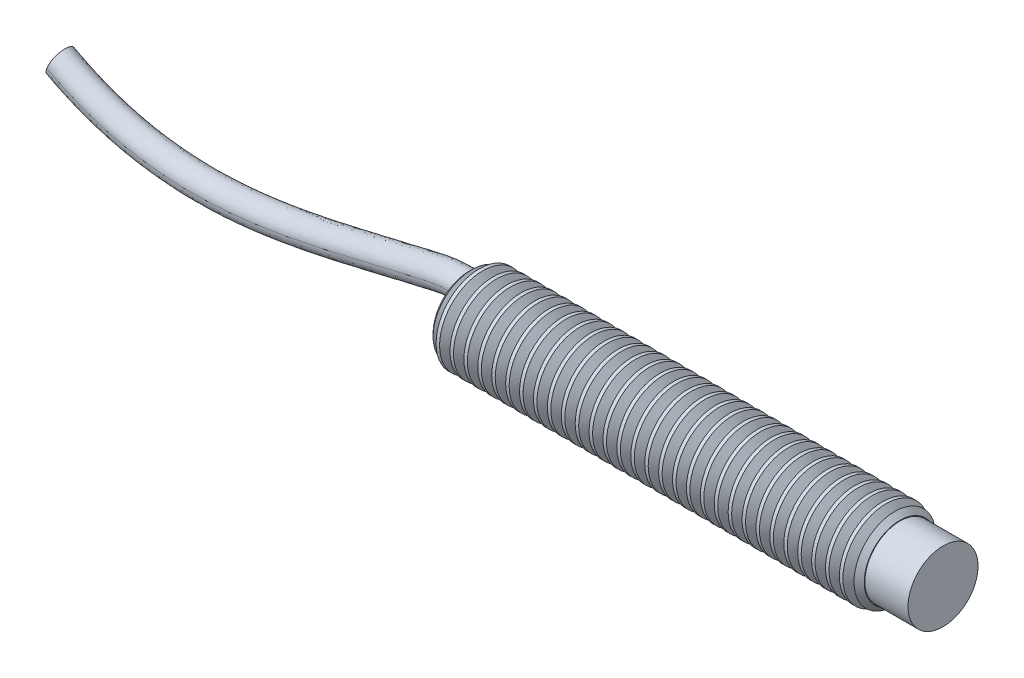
ISO-10303-21;
HEADER;
FILE_DESCRIPTION(('STEP AP214'),'2;1');
FILE_NAME('part.step','',(''),(''),'','','');
FILE_SCHEMA(('AUTOMOTIVE_DESIGN { 1 0 10303 214 1 1 1 1 }'));
ENDSEC;
DATA;
#1=APPLICATION_CONTEXT('core data for automotive mechanical design processes');
#2=APPLICATION_PROTOCOL_DEFINITION('international standard','automotive_design',2000,#1);
#3=PRODUCT_CONTEXT('',#1,'mechanical');
#4=PRODUCT('Part','Part','',(#3));
#5=PRODUCT_RELATED_PRODUCT_CATEGORY('part','',(#4));
#6=PRODUCT_DEFINITION_FORMATION('','',#4);
#7=PRODUCT_DEFINITION_CONTEXT('part definition',#1,'design');
#8=PRODUCT_DEFINITION('design','',#6,#7);
#9=PRODUCT_DEFINITION_SHAPE('','',#8);
#10=(LENGTH_UNIT() NAMED_UNIT(*) SI_UNIT(.MILLI.,.METRE.));
#11=(NAMED_UNIT(*) PLANE_ANGLE_UNIT() SI_UNIT($,.RADIAN.));
#12=(NAMED_UNIT(*) SI_UNIT($,.STERADIAN.) SOLID_ANGLE_UNIT());
#13=UNCERTAINTY_MEASURE_WITH_UNIT(LENGTH_MEASURE(1.E-05),#10,'distance_accuracy_value','');
#14=(GEOMETRIC_REPRESENTATION_CONTEXT(3) GLOBAL_UNCERTAINTY_ASSIGNED_CONTEXT((#13)) GLOBAL_UNIT_ASSIGNED_CONTEXT((#10,
#11,#12)) REPRESENTATION_CONTEXT('',''));
#15=CARTESIAN_POINT('',(0.,0.,0.));
#16=DIRECTION('',(0.,0.,1.));
#17=DIRECTION('',(1.,0.,0.));
#18=AXIS2_PLACEMENT_3D('',#15,#16,#17);
#19=CARTESIAN_POINT('',(44.,0.,0.));
#20=DIRECTION('',(1.,0.,0.));
#21=DIRECTION('',(0.,0.,-1.));
#22=AXIS2_PLACEMENT_3D('',#19,#20,#21);
#23=PLANE('',#22);
#24=CARTESIAN_POINT('',(44.,0.,0.));
#25=DIRECTION('',(-1.,0.,0.));
#26=DIRECTION('',(0.,0.,1.));
#27=AXIS2_PLACEMENT_3D('',#24,#25,#26);
#28=CIRCLE('',#27,3.25);
#29=CARTESIAN_POINT('',(44.,0.,3.25));
#30=VERTEX_POINT('',#29);
#31=EDGE_CURVE('E20',#30,#30,#28,.T.);
#32=ORIENTED_EDGE('',*,*,#31,.F.);
#33=EDGE_LOOP('',(#32));
#34=FACE_BOUND('',#33,.T.);
#35=ADVANCED_FACE('F17',(#34),#23,.T.);
#36=CARTESIAN_POINT('',(44.,0.,0.));
#37=DIRECTION('',(-1.,0.,0.));
#38=DIRECTION('',(0.,0.,1.));
#39=AXIS2_PLACEMENT_3D('',#36,#37,#38);
#40=CYLINDRICAL_SURFACE('',#39,3.25);
#41=CARTESIAN_POINT('',(40.,0.,0.));
#42=DIRECTION('',(-1.,0.,0.));
#43=DIRECTION('',(0.,0.,1.));
#44=AXIS2_PLACEMENT_3D('',#41,#42,#43);
#45=CIRCLE('',#44,3.25);
#46=CARTESIAN_POINT('',(40.,0.,3.25));
#47=VERTEX_POINT('',#46);
#48=EDGE_CURVE('E406',#47,#47,#45,.T.);
#49=ORIENTED_EDGE('',*,*,#48,.F.);
#50=EDGE_LOOP('',(#49));
#51=FACE_BOUND('',#50,.T.);
#52=ORIENTED_EDGE('',*,*,#31,.T.);
#53=EDGE_LOOP('',(#52));
#54=FACE_BOUND('',#53,.T.);
#55=ADVANCED_FACE('F413',(#51,#54),#40,.T.);
#56=CARTESIAN_POINT('',(40.,4.,0.));
#57=DIRECTION('',(1.,0.,0.));
#58=DIRECTION('',(0.,0.,-1.));
#59=AXIS2_PLACEMENT_3D('',#56,#57,#58);
#60=PLANE('',#59);
#61=ORIENTED_EDGE('',*,*,#48,.T.);
#62=EDGE_LOOP('',(#61));
#63=FACE_BOUND('',#62,.T.);
#64=CARTESIAN_POINT('',(39.9999999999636,0.,0.));
#65=DIRECTION('',(-1.,0.,0.));
#66=DIRECTION('',(0.,0.,1.));
#67=AXIS2_PLACEMENT_3D('',#64,#65,#66);
#68=CIRCLE('',#67,3.3095000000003);
#69=CARTESIAN_POINT('',(39.9999999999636,0.,3.3095000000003));
#70=VERTEX_POINT('',#69);
#71=EDGE_CURVE('E346',#70,#70,#68,.T.);
#72=ORIENTED_EDGE('',*,*,#71,.F.);
#73=EDGE_LOOP('',(#72));
#74=FACE_BOUND('',#73,.T.);
#75=ADVANCED_FACE('F419',(#63,#74),#60,.T.);
#76=CARTESIAN_POINT('',(39.5254524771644,0.,0.));
#77=DIRECTION('',(-1.,0.,0.));
#78=DIRECTION('',(0.,0.,1.));
#79=AXIS2_PLACEMENT_3D('',#76,#77,#78);
#80=CONICAL_SURFACE('',#79,3.78404752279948,0.785398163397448);
#81=CARTESIAN_POINT('',(39.5254524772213,0.,0.));
#82=DIRECTION('',(1.,0.,0.));
#83=DIRECTION('',(0.,1.,0.));
#84=AXIS2_PLACEMENT_3D('',#81,#82,#83);
#85=CIRCLE('',#84,3.78404752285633);
#86=CARTESIAN_POINT('',(39.5254524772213,3.78404752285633,0.));
#87=VERTEX_POINT('',#86);
#88=EDGE_CURVE('E344',#87,#87,#85,.F.);
#89=ORIENTED_EDGE('',*,*,#88,.F.);
#90=EDGE_LOOP('',(#89));
#91=FACE_BOUND('',#90,.T.);
#92=ORIENTED_EDGE('',*,*,#71,.T.);
#93=EDGE_LOOP('',(#92));
#94=FACE_BOUND('',#93,.T.);
#95=ADVANCED_FACE('F424',(#91,#94),#80,.T.);
#96=CARTESIAN_POINT('',(39.5254524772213,0.,0.));
#97=DIRECTION('',(1.,0.,0.));
#98=DIRECTION('',(0.,0.,-1.));
#99=AXIS2_PLACEMENT_3D('',#96,#97,#98);
#100=CONICAL_SURFACE('',#99,3.78404752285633,0.959931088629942);
#101=ORIENTED_EDGE('',*,*,#88,.T.);
#102=EDGE_LOOP('',(#101));
#103=FACE_BOUND('',#102,.T.);
#104=CARTESIAN_POINT('',(39.1931707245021,0.,0.));
#105=DIRECTION('',(-1.,0.,0.));
#106=DIRECTION('',(0.,-1.,0.));
#107=AXIS2_PLACEMENT_3D('',#104,#105,#106);
#108=CIRCLE('',#107,3.30950000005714);
#109=CARTESIAN_POINT('',(39.1931707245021,-3.30950000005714,0.));
#110=VERTEX_POINT('',#109);
#111=EDGE_CURVE('E341',#110,#110,#108,.T.);
#112=ORIENTED_EDGE('',*,*,#111,.F.);
#113=EDGE_LOOP('',(#112));
#114=FACE_BOUND('',#113,.T.);
#115=ADVANCED_FACE('F429',(#103,#114),#100,.T.);
#116=CARTESIAN_POINT('',(38.7096774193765,0.,0.));
#117=DIRECTION('',(-1.,0.,0.));
#118=DIRECTION('',(0.,0.,1.));
#119=AXIS2_PLACEMENT_3D('',#116,#117,#118);
#120=CONICAL_SURFACE('',#119,4.0000000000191,0.959931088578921);
#121=CARTESIAN_POINT('',(38.7096774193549,0.,0.));
#122=DIRECTION('',(-1.,0.,0.));
#123=DIRECTION('',(0.,0.,1.));
#124=AXIS2_PLACEMENT_3D('',#121,#122,#123);
#125=CIRCLE('',#124,4.);
#126=CARTESIAN_POINT('',(38.7096774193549,0.,4.));
#127=VERTEX_POINT('',#126);
#128=EDGE_CURVE('E338',#127,#127,#125,.T.);
#129=ORIENTED_EDGE('',*,*,#128,.F.);
#130=EDGE_LOOP('',(#129));
#131=FACE_BOUND('',#130,.T.);
#132=ORIENTED_EDGE('',*,*,#111,.T.);
#133=EDGE_LOOP('',(#132));
#134=FACE_BOUND('',#133,.T.);
#135=ADVANCED_FACE('F433',(#131,#134),#120,.T.);
#136=CARTESIAN_POINT('',(-3.175,0.,0.));
#137=DIRECTION('',(-1.,0.,0.));
#138=DIRECTION('',(0.,0.,1.));
#139=AXIS2_PLACEMENT_3D('',#136,#137,#138);
#140=CYLINDRICAL_SURFACE('',#139,4.);
#141=ORIENTED_EDGE('',*,*,#128,.T.);
#142=EDGE_LOOP('',(#141));
#143=FACE_BOUND('',#142,.T.);
#144=CARTESIAN_POINT('',(38.3863414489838,0.,0.));
#145=DIRECTION('',(1.,0.,0.));
#146=DIRECTION('',(0.,1.,0.));
#147=AXIS2_PLACEMENT_3D('',#144,#145,#146);
#148=CIRCLE('',#147,3.99999999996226);
#149=CARTESIAN_POINT('',(38.3863414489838,3.99999999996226,0.));
#150=VERTEX_POINT('',#149);
#151=EDGE_CURVE('E335',#150,#150,#148,.F.);
#152=ORIENTED_EDGE('',*,*,#151,.F.);
#153=EDGE_LOOP('',(#152));
#154=FACE_BOUND('',#153,.T.);
#155=ADVANCED_FACE('F437',(#143,#154),#140,.T.);
#156=CARTESIAN_POINT('',(38.3863414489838,0.,0.));
#157=DIRECTION('',(1.,0.,0.));
#158=DIRECTION('',(0.,0.,-1.));
#159=AXIS2_PLACEMENT_3D('',#156,#157,#158);
#160=CONICAL_SURFACE('',#159,3.99999999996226,0.959931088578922);
#161=CARTESIAN_POINT('',(37.9028481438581,0.,0.));
#162=DIRECTION('',(-1.,0.,0.));
#163=DIRECTION('',(0.,-1.,0.));
#164=AXIS2_PLACEMENT_3D('',#161,#162,#163);
#165=CIRCLE('',#164,3.30950000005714);
#166=CARTESIAN_POINT('',(37.9028481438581,-3.30950000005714,0.));
#167=VERTEX_POINT('',#166);
#168=EDGE_CURVE('E332',#167,#167,#165,.T.);
#169=ORIENTED_EDGE('',*,*,#168,.F.);
#170=EDGE_LOOP('',(#169));
#171=FACE_BOUND('',#170,.T.);
#172=ORIENTED_EDGE('',*,*,#151,.T.);
#173=EDGE_LOOP('',(#172));
#174=FACE_BOUND('',#173,.T.);
#175=ADVANCED_FACE('F441',(#171,#174),#160,.T.);
#176=CARTESIAN_POINT('',(37.4193548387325,0.,0.));
#177=DIRECTION('',(-1.,0.,0.));
#178=DIRECTION('',(0.,0.,1.));
#179=AXIS2_PLACEMENT_3D('',#176,#177,#178);
#180=CONICAL_SURFACE('',#179,4.0000000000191,0.959931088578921);
#181=ORIENTED_EDGE('',*,*,#168,.T.);
#182=EDGE_LOOP('',(#181));
#183=FACE_BOUND('',#182,.T.);
#184=CARTESIAN_POINT('',(37.4193548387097,0.,0.));
#185=DIRECTION('',(-1.,0.,0.));
#186=DIRECTION('',(0.,0.,1.));
#187=AXIS2_PLACEMENT_3D('',#184,#185,#186);
#188=CIRCLE('',#187,4.);
#189=CARTESIAN_POINT('',(37.4193548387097,0.,4.));
#190=VERTEX_POINT('',#189);
#191=EDGE_CURVE('E329',#190,#190,#188,.T.);
#192=ORIENTED_EDGE('',*,*,#191,.F.);
#193=EDGE_LOOP('',(#192));
#194=FACE_BOUND('',#193,.T.);
#195=ADVANCED_FACE('F445',(#183,#194),#180,.T.);
#196=CARTESIAN_POINT('',(-3.175,0.,0.));
#197=DIRECTION('',(-1.,0.,0.));
#198=DIRECTION('',(0.,0.,1.));
#199=AXIS2_PLACEMENT_3D('',#196,#197,#198);
#200=CYLINDRICAL_SURFACE('',#199,4.);
#201=CARTESIAN_POINT('',(37.0960188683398,0.,0.));
#202=DIRECTION('',(1.,0.,0.));
#203=DIRECTION('',(0.,1.,0.));
#204=AXIS2_PLACEMENT_3D('',#201,#202,#203);
#205=CIRCLE('',#204,3.99999999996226);
#206=CARTESIAN_POINT('',(37.0960188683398,3.99999999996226,0.));
#207=VERTEX_POINT('',#206);
#208=EDGE_CURVE('E326',#207,#207,#205,.F.);
#209=ORIENTED_EDGE('',*,*,#208,.F.);
#210=EDGE_LOOP('',(#209));
#211=FACE_BOUND('',#210,.T.);
#212=ORIENTED_EDGE('',*,*,#191,.T.);
#213=EDGE_LOOP('',(#212));
#214=FACE_BOUND('',#213,.T.);
#215=ADVANCED_FACE('F449',(#211,#214),#200,.T.);
#216=CARTESIAN_POINT('',(37.0960188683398,0.,0.));
#217=DIRECTION('',(1.,0.,0.));
#218=DIRECTION('',(0.,0.,-1.));
#219=AXIS2_PLACEMENT_3D('',#216,#217,#218);
#220=CONICAL_SURFACE('',#219,3.99999999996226,0.959931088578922);
#221=ORIENTED_EDGE('',*,*,#208,.T.);
#222=EDGE_LOOP('',(#221));
#223=FACE_BOUND('',#222,.T.);
#224=CARTESIAN_POINT('',(36.6125255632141,0.,0.));
#225=DIRECTION('',(-1.,0.,0.));
#226=DIRECTION('',(0.,-1.,0.));
#227=AXIS2_PLACEMENT_3D('',#224,#225,#226);
#228=CIRCLE('',#227,3.30950000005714);
#229=CARTESIAN_POINT('',(36.6125255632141,-3.30950000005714,0.));
#230=VERTEX_POINT('',#229);
#231=EDGE_CURVE('E323',#230,#230,#228,.T.);
#232=ORIENTED_EDGE('',*,*,#231,.F.);
#233=EDGE_LOOP('',(#232));
#234=FACE_BOUND('',#233,.T.);
#235=ADVANCED_FACE('F453',(#223,#234),#220,.T.);
#236=CARTESIAN_POINT('',(36.1290322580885,0.,0.));
#237=DIRECTION('',(-1.,0.,0.));
#238=DIRECTION('',(0.,0.,1.));
#239=AXIS2_PLACEMENT_3D('',#236,#237,#238);
#240=CONICAL_SURFACE('',#239,4.0000000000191,0.959931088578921);
#241=CARTESIAN_POINT('',(36.1290322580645,0.,0.));
#242=DIRECTION('',(-1.,0.,0.));
#243=DIRECTION('',(0.,0.,1.));
#244=AXIS2_PLACEMENT_3D('',#241,#242,#243);
#245=CIRCLE('',#244,4.);
#246=CARTESIAN_POINT('',(36.1290322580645,0.,4.));
#247=VERTEX_POINT('',#246);
#248=EDGE_CURVE('E320',#247,#247,#245,.T.);
#249=ORIENTED_EDGE('',*,*,#248,.F.);
#250=EDGE_LOOP('',(#249));
#251=FACE_BOUND('',#250,.T.);
#252=ORIENTED_EDGE('',*,*,#231,.T.);
#253=EDGE_LOOP('',(#252));
#254=FACE_BOUND('',#253,.T.);
#255=ADVANCED_FACE('F457',(#251,#254),#240,.T.);
#256=CARTESIAN_POINT('',(-3.175,0.,0.));
#257=DIRECTION('',(-1.,0.,0.));
#258=DIRECTION('',(0.,0.,1.));
#259=AXIS2_PLACEMENT_3D('',#256,#257,#258);
#260=CYLINDRICAL_SURFACE('',#259,4.);
#261=ORIENTED_EDGE('',*,*,#248,.T.);
#262=EDGE_LOOP('',(#261));
#263=FACE_BOUND('',#262,.T.);
#264=CARTESIAN_POINT('',(35.8056962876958,0.,0.));
#265=DIRECTION('',(1.,0.,0.));
#266=DIRECTION('',(0.,1.,0.));
#267=AXIS2_PLACEMENT_3D('',#264,#265,#266);
#268=CIRCLE('',#267,3.99999999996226);
#269=CARTESIAN_POINT('',(35.8056962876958,3.99999999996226,0.));
#270=VERTEX_POINT('',#269);
#271=EDGE_CURVE('E317',#270,#270,#268,.F.);
#272=ORIENTED_EDGE('',*,*,#271,.F.);
#273=EDGE_LOOP('',(#272));
#274=FACE_BOUND('',#273,.T.);
#275=ADVANCED_FACE('F461',(#263,#274),#260,.T.);
#276=CARTESIAN_POINT('',(35.8056962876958,0.,0.));
#277=DIRECTION('',(1.,0.,0.));
#278=DIRECTION('',(0.,0.,-1.));
#279=AXIS2_PLACEMENT_3D('',#276,#277,#278);
#280=CONICAL_SURFACE('',#279,3.99999999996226,0.959931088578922);
#281=CARTESIAN_POINT('',(35.3222029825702,0.,0.));
#282=DIRECTION('',(-1.,0.,0.));
#283=DIRECTION('',(0.,-1.,0.));
#284=AXIS2_PLACEMENT_3D('',#281,#282,#283);
#285=CIRCLE('',#284,3.30950000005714);
#286=CARTESIAN_POINT('',(35.3222029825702,-3.30950000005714,0.));
#287=VERTEX_POINT('',#286);
#288=EDGE_CURVE('E314',#287,#287,#285,.T.);
#289=ORIENTED_EDGE('',*,*,#288,.F.);
#290=EDGE_LOOP('',(#289));
#291=FACE_BOUND('',#290,.T.);
#292=ORIENTED_EDGE('',*,*,#271,.T.);
#293=EDGE_LOOP('',(#292));
#294=FACE_BOUND('',#293,.T.);
#295=ADVANCED_FACE('F465',(#291,#294),#280,.T.);
#296=CARTESIAN_POINT('',(34.8387096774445,0.,0.));
#297=DIRECTION('',(-1.,0.,0.));
#298=DIRECTION('',(0.,0.,1.));
#299=AXIS2_PLACEMENT_3D('',#296,#297,#298);
#300=CONICAL_SURFACE('',#299,4.0000000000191,0.959931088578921);
#301=ORIENTED_EDGE('',*,*,#288,.T.);
#302=EDGE_LOOP('',(#301));
#303=FACE_BOUND('',#302,.T.);
#304=CARTESIAN_POINT('',(34.8387096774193,0.,0.));
#305=DIRECTION('',(-1.,0.,0.));
#306=DIRECTION('',(0.,0.,1.));
#307=AXIS2_PLACEMENT_3D('',#304,#305,#306);
#308=CIRCLE('',#307,4.);
#309=CARTESIAN_POINT('',(34.8387096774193,0.,4.));
#310=VERTEX_POINT('',#309);
#311=EDGE_CURVE('E311',#310,#310,#308,.T.);
#312=ORIENTED_EDGE('',*,*,#311,.F.);
#313=EDGE_LOOP('',(#312));
#314=FACE_BOUND('',#313,.T.);
#315=ADVANCED_FACE('F469',(#303,#314),#300,.T.);
#316=CARTESIAN_POINT('',(-3.175,0.,0.));
#317=DIRECTION('',(-1.,0.,0.));
#318=DIRECTION('',(0.,0.,1.));
#319=AXIS2_PLACEMENT_3D('',#316,#317,#318);
#320=CYLINDRICAL_SURFACE('',#319,4.);
#321=CARTESIAN_POINT('',(34.5153737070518,0.,0.));
#322=DIRECTION('',(1.,0.,0.));
#323=DIRECTION('',(0.,1.,0.));
#324=AXIS2_PLACEMENT_3D('',#321,#322,#323);
#325=CIRCLE('',#324,3.99999999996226);
#326=CARTESIAN_POINT('',(34.5153737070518,3.99999999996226,0.));
#327=VERTEX_POINT('',#326);
#328=EDGE_CURVE('E308',#327,#327,#325,.F.);
#329=ORIENTED_EDGE('',*,*,#328,.F.);
#330=EDGE_LOOP('',(#329));
#331=FACE_BOUND('',#330,.T.);
#332=ORIENTED_EDGE('',*,*,#311,.T.);
#333=EDGE_LOOP('',(#332));
#334=FACE_BOUND('',#333,.T.);
#335=ADVANCED_FACE('F473',(#331,#334),#320,.T.);
#336=CARTESIAN_POINT('',(34.5153737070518,0.,0.));
#337=DIRECTION('',(1.,0.,0.));
#338=DIRECTION('',(0.,0.,-1.));
#339=AXIS2_PLACEMENT_3D('',#336,#337,#338);
#340=CONICAL_SURFACE('',#339,3.99999999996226,0.959931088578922);
#341=ORIENTED_EDGE('',*,*,#328,.T.);
#342=EDGE_LOOP('',(#341));
#343=FACE_BOUND('',#342,.T.);
#344=CARTESIAN_POINT('',(34.0318804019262,0.,0.));
#345=DIRECTION('',(-1.,0.,0.));
#346=DIRECTION('',(0.,-1.,0.));
#347=AXIS2_PLACEMENT_3D('',#344,#345,#346);
#348=CIRCLE('',#347,3.30950000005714);
#349=CARTESIAN_POINT('',(34.0318804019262,-3.30950000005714,0.));
#350=VERTEX_POINT('',#349);
#351=EDGE_CURVE('E305',#350,#350,#348,.T.);
#352=ORIENTED_EDGE('',*,*,#351,.F.);
#353=EDGE_LOOP('',(#352));
#354=FACE_BOUND('',#353,.T.);
#355=ADVANCED_FACE('F477',(#343,#354),#340,.T.);
#356=CARTESIAN_POINT('',(33.5483870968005,0.,0.));
#357=DIRECTION('',(-1.,0.,0.));
#358=DIRECTION('',(0.,0.,1.));
#359=AXIS2_PLACEMENT_3D('',#356,#357,#358);
#360=CONICAL_SURFACE('',#359,4.0000000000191,0.959931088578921);
#361=CARTESIAN_POINT('',(33.5483870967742,0.,0.));
#362=DIRECTION('',(-1.,0.,0.));
#363=DIRECTION('',(0.,0.,1.));
#364=AXIS2_PLACEMENT_3D('',#361,#362,#363);
#365=CIRCLE('',#364,4.);
#366=CARTESIAN_POINT('',(33.5483870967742,0.,4.));
#367=VERTEX_POINT('',#366);
#368=EDGE_CURVE('E302',#367,#367,#365,.T.);
#369=ORIENTED_EDGE('',*,*,#368,.F.);
#370=EDGE_LOOP('',(#369));
#371=FACE_BOUND('',#370,.T.);
#372=ORIENTED_EDGE('',*,*,#351,.T.);
#373=EDGE_LOOP('',(#372));
#374=FACE_BOUND('',#373,.T.);
#375=ADVANCED_FACE('F481',(#371,#374),#360,.T.);
#376=CARTESIAN_POINT('',(-3.175,0.,0.));
#377=DIRECTION('',(-1.,0.,0.));
#378=DIRECTION('',(0.,0.,1.));
#379=AXIS2_PLACEMENT_3D('',#376,#377,#378);
#380=CYLINDRICAL_SURFACE('',#379,4.);
#381=ORIENTED_EDGE('',*,*,#368,.T.);
#382=EDGE_LOOP('',(#381));
#383=FACE_BOUND('',#382,.T.);
#384=CARTESIAN_POINT('',(33.2250511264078,0.,0.));
#385=DIRECTION('',(1.,0.,0.));
#386=DIRECTION('',(0.,1.,0.));
#387=AXIS2_PLACEMENT_3D('',#384,#385,#386);
#388=CIRCLE('',#387,3.99999999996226);
#389=CARTESIAN_POINT('',(33.2250511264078,3.99999999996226,0.));
#390=VERTEX_POINT('',#389);
#391=EDGE_CURVE('E299',#390,#390,#388,.F.);
#392=ORIENTED_EDGE('',*,*,#391,.F.);
#393=EDGE_LOOP('',(#392));
#394=FACE_BOUND('',#393,.T.);
#395=ADVANCED_FACE('F485',(#383,#394),#380,.T.);
#396=CARTESIAN_POINT('',(33.2250511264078,0.,0.));
#397=DIRECTION('',(1.,0.,0.));
#398=DIRECTION('',(0.,0.,-1.));
#399=AXIS2_PLACEMENT_3D('',#396,#397,#398);
#400=CONICAL_SURFACE('',#399,3.99999999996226,0.959931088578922);
#401=CARTESIAN_POINT('',(32.7415578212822,0.,0.));
#402=DIRECTION('',(-1.,0.,0.));
#403=DIRECTION('',(0.,-1.,0.));
#404=AXIS2_PLACEMENT_3D('',#401,#402,#403);
#405=CIRCLE('',#404,3.30950000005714);
#406=CARTESIAN_POINT('',(32.7415578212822,-3.30950000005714,0.));
#407=VERTEX_POINT('',#406);
#408=EDGE_CURVE('E296',#407,#407,#405,.T.);
#409=ORIENTED_EDGE('',*,*,#408,.F.);
#410=EDGE_LOOP('',(#409));
#411=FACE_BOUND('',#410,.T.);
#412=ORIENTED_EDGE('',*,*,#391,.T.);
#413=EDGE_LOOP('',(#412));
#414=FACE_BOUND('',#413,.T.);
#415=ADVANCED_FACE('F489',(#411,#414),#400,.T.);
#416=CARTESIAN_POINT('',(32.2580645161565,0.,0.));
#417=DIRECTION('',(-1.,0.,0.));
#418=DIRECTION('',(0.,0.,1.));
#419=AXIS2_PLACEMENT_3D('',#416,#417,#418);
#420=CONICAL_SURFACE('',#419,4.0000000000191,0.959931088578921);
#421=ORIENTED_EDGE('',*,*,#408,.T.);
#422=EDGE_LOOP('',(#421));
#423=FACE_BOUND('',#422,.T.);
#424=CARTESIAN_POINT('',(32.2580645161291,0.,0.));
#425=DIRECTION('',(-1.,0.,0.));
#426=DIRECTION('',(0.,0.,1.));
#427=AXIS2_PLACEMENT_3D('',#424,#425,#426);
#428=CIRCLE('',#427,4.);
#429=CARTESIAN_POINT('',(32.2580645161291,0.,4.));
#430=VERTEX_POINT('',#429);
#431=EDGE_CURVE('E293',#430,#430,#428,.T.);
#432=ORIENTED_EDGE('',*,*,#431,.F.);
#433=EDGE_LOOP('',(#432));
#434=FACE_BOUND('',#433,.T.);
#435=ADVANCED_FACE('F493',(#423,#434),#420,.T.);
#436=CARTESIAN_POINT('',(-3.175,0.,0.));
#437=DIRECTION('',(-1.,0.,0.));
#438=DIRECTION('',(0.,0.,1.));
#439=AXIS2_PLACEMENT_3D('',#436,#437,#438);
#440=CYLINDRICAL_SURFACE('',#439,4.);
#441=CARTESIAN_POINT('',(31.9347285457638,0.,0.));
#442=DIRECTION('',(1.,0.,0.));
#443=DIRECTION('',(0.,1.,0.));
#444=AXIS2_PLACEMENT_3D('',#441,#442,#443);
#445=CIRCLE('',#444,3.99999999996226);
#446=CARTESIAN_POINT('',(31.9347285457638,3.99999999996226,0.));
#447=VERTEX_POINT('',#446);
#448=EDGE_CURVE('E290',#447,#447,#445,.F.);
#449=ORIENTED_EDGE('',*,*,#448,.F.);
#450=EDGE_LOOP('',(#449));
#451=FACE_BOUND('',#450,.T.);
#452=ORIENTED_EDGE('',*,*,#431,.T.);
#453=EDGE_LOOP('',(#452));
#454=FACE_BOUND('',#453,.T.);
#455=ADVANCED_FACE('F497',(#451,#454),#440,.T.);
#456=CARTESIAN_POINT('',(31.9347285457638,0.,0.));
#457=DIRECTION('',(1.,0.,0.));
#458=DIRECTION('',(0.,0.,-1.));
#459=AXIS2_PLACEMENT_3D('',#456,#457,#458);
#460=CONICAL_SURFACE('',#459,3.99999999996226,0.959931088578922);
#461=ORIENTED_EDGE('',*,*,#448,.T.);
#462=EDGE_LOOP('',(#461));
#463=FACE_BOUND('',#462,.T.);
#464=CARTESIAN_POINT('',(31.4512352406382,0.,0.));
#465=DIRECTION('',(-1.,0.,0.));
#466=DIRECTION('',(0.,-1.,0.));
#467=AXIS2_PLACEMENT_3D('',#464,#465,#466);
#468=CIRCLE('',#467,3.30950000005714);
#469=CARTESIAN_POINT('',(31.4512352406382,-3.30950000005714,0.));
#470=VERTEX_POINT('',#469);
#471=EDGE_CURVE('E287',#470,#470,#468,.T.);
#472=ORIENTED_EDGE('',*,*,#471,.F.);
#473=EDGE_LOOP('',(#472));
#474=FACE_BOUND('',#473,.T.);
#475=ADVANCED_FACE('F501',(#463,#474),#460,.T.);
#476=CARTESIAN_POINT('',(30.9677419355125,0.,0.));
#477=DIRECTION('',(-1.,0.,0.));
#478=DIRECTION('',(0.,0.,1.));
#479=AXIS2_PLACEMENT_3D('',#476,#477,#478);
#480=CONICAL_SURFACE('',#479,4.0000000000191,0.959931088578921);
#481=CARTESIAN_POINT('',(30.9677419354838,0.,0.));
#482=DIRECTION('',(-1.,0.,0.));
#483=DIRECTION('',(0.,0.,1.));
#484=AXIS2_PLACEMENT_3D('',#481,#482,#483);
#485=CIRCLE('',#484,4.);
#486=CARTESIAN_POINT('',(30.9677419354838,0.,4.));
#487=VERTEX_POINT('',#486);
#488=EDGE_CURVE('E284',#487,#487,#485,.T.);
#489=ORIENTED_EDGE('',*,*,#488,.F.);
#490=EDGE_LOOP('',(#489));
#491=FACE_BOUND('',#490,.T.);
#492=ORIENTED_EDGE('',*,*,#471,.T.);
#493=EDGE_LOOP('',(#492));
#494=FACE_BOUND('',#493,.T.);
#495=ADVANCED_FACE('F505',(#491,#494),#480,.T.);
#496=CARTESIAN_POINT('',(-3.175,0.,0.));
#497=DIRECTION('',(-1.,0.,0.));
#498=DIRECTION('',(0.,0.,1.));
#499=AXIS2_PLACEMENT_3D('',#496,#497,#498);
#500=CYLINDRICAL_SURFACE('',#499,4.);
#501=ORIENTED_EDGE('',*,*,#488,.T.);
#502=EDGE_LOOP('',(#501));
#503=FACE_BOUND('',#502,.T.);
#504=CARTESIAN_POINT('',(30.6444059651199,0.,0.));
#505=DIRECTION('',(1.,0.,0.));
#506=DIRECTION('',(0.,1.,0.));
#507=AXIS2_PLACEMENT_3D('',#504,#505,#506);
#508=CIRCLE('',#507,3.99999999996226);
#509=CARTESIAN_POINT('',(30.6444059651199,3.99999999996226,0.));
#510=VERTEX_POINT('',#509);
#511=EDGE_CURVE('E281',#510,#510,#508,.F.);
#512=ORIENTED_EDGE('',*,*,#511,.F.);
#513=EDGE_LOOP('',(#512));
#514=FACE_BOUND('',#513,.T.);
#515=ADVANCED_FACE('F509',(#503,#514),#500,.T.);
#516=CARTESIAN_POINT('',(30.6444059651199,0.,0.));
#517=DIRECTION('',(1.,0.,0.));
#518=DIRECTION('',(0.,0.,-1.));
#519=AXIS2_PLACEMENT_3D('',#516,#517,#518);
#520=CONICAL_SURFACE('',#519,3.99999999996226,0.959931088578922);
#521=CARTESIAN_POINT('',(30.1609126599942,0.,0.));
#522=DIRECTION('',(-1.,0.,0.));
#523=DIRECTION('',(0.,-1.,0.));
#524=AXIS2_PLACEMENT_3D('',#521,#522,#523);
#525=CIRCLE('',#524,3.3095000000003);
#526=CARTESIAN_POINT('',(30.1609126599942,-3.3095000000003,0.));
#527=VERTEX_POINT('',#526);
#528=EDGE_CURVE('E278',#527,#527,#525,.T.);
#529=ORIENTED_EDGE('',*,*,#528,.F.);
#530=EDGE_LOOP('',(#529));
#531=FACE_BOUND('',#530,.T.);
#532=ORIENTED_EDGE('',*,*,#511,.T.);
#533=EDGE_LOOP('',(#532));
#534=FACE_BOUND('',#533,.T.);
#535=ADVANCED_FACE('F513',(#531,#534),#520,.T.);
#536=CARTESIAN_POINT('',(29.6774193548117,0.,0.));
#537=DIRECTION('',(-1.,0.,0.));
#538=DIRECTION('',(0.,0.,1.));
#539=AXIS2_PLACEMENT_3D('',#536,#537,#538);
#540=CONICAL_SURFACE('',#539,4.00000000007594,0.959931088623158);
#541=ORIENTED_EDGE('',*,*,#528,.T.);
#542=EDGE_LOOP('',(#541));
#543=FACE_BOUND('',#542,.T.);
#544=CARTESIAN_POINT('',(29.6774193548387,0.,0.));
#545=DIRECTION('',(-1.,0.,0.));
#546=DIRECTION('',(0.,0.,1.));
#547=AXIS2_PLACEMENT_3D('',#544,#545,#546);
#548=CIRCLE('',#547,4.);
#549=CARTESIAN_POINT('',(29.6774193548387,0.,4.));
#550=VERTEX_POINT('',#549);
#551=EDGE_CURVE('E275',#550,#550,#548,.T.);
#552=ORIENTED_EDGE('',*,*,#551,.F.);
#553=EDGE_LOOP('',(#552));
#554=FACE_BOUND('',#553,.T.);
#555=ADVANCED_FACE('F517',(#543,#554),#540,.T.);
#556=CARTESIAN_POINT('',(-3.175,0.,0.));
#557=DIRECTION('',(-1.,0.,0.));
#558=DIRECTION('',(0.,0.,1.));
#559=AXIS2_PLACEMENT_3D('',#556,#557,#558);
#560=CYLINDRICAL_SURFACE('',#559,4.);
#561=CARTESIAN_POINT('',(29.3540833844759,0.,0.));
#562=DIRECTION('',(1.,0.,0.));
#563=DIRECTION('',(0.,1.,0.));
#564=AXIS2_PLACEMENT_3D('',#561,#562,#563);
#565=CIRCLE('',#564,3.99999999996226);
#566=CARTESIAN_POINT('',(29.3540833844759,3.99999999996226,0.));
#567=VERTEX_POINT('',#566);
#568=EDGE_CURVE('E272',#567,#567,#565,.F.);
#569=ORIENTED_EDGE('',*,*,#568,.F.);
#570=EDGE_LOOP('',(#569));
#571=FACE_BOUND('',#570,.T.);
#572=ORIENTED_EDGE('',*,*,#551,.T.);
#573=EDGE_LOOP('',(#572));
#574=FACE_BOUND('',#573,.T.);
#575=ADVANCED_FACE('F521',(#571,#574),#560,.T.);
#576=CARTESIAN_POINT('',(29.3540833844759,0.,0.));
#577=DIRECTION('',(1.,0.,0.));
#578=DIRECTION('',(0.,0.,-1.));
#579=AXIS2_PLACEMENT_3D('',#576,#577,#578);
#580=CONICAL_SURFACE('',#579,3.99999999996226,0.959931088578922);
#581=ORIENTED_EDGE('',*,*,#568,.T.);
#582=EDGE_LOOP('',(#581));
#583=FACE_BOUND('',#582,.T.);
#584=CARTESIAN_POINT('',(28.8705900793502,0.,0.));
#585=DIRECTION('',(-1.,0.,0.));
#586=DIRECTION('',(0.,-1.,0.));
#587=AXIS2_PLACEMENT_3D('',#584,#585,#586);
#588=CIRCLE('',#587,3.3095000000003);
#589=CARTESIAN_POINT('',(28.8705900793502,-3.3095000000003,0.));
#590=VERTEX_POINT('',#589);
#591=EDGE_CURVE('E269',#590,#590,#588,.T.);
#592=ORIENTED_EDGE('',*,*,#591,.F.);
#593=EDGE_LOOP('',(#592));
#594=FACE_BOUND('',#593,.T.);
#595=ADVANCED_FACE('F525',(#583,#594),#580,.T.);
#596=CARTESIAN_POINT('',(28.3870967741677,0.,0.));
#597=DIRECTION('',(-1.,0.,0.));
#598=DIRECTION('',(0.,0.,1.));
#599=AXIS2_PLACEMENT_3D('',#596,#597,#598);
#600=CONICAL_SURFACE('',#599,4.00000000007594,0.959931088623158);
#601=CARTESIAN_POINT('',(28.3870967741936,0.,0.));
#602=DIRECTION('',(-1.,0.,0.));
#603=DIRECTION('',(0.,0.,1.));
#604=AXIS2_PLACEMENT_3D('',#601,#602,#603);
#605=CIRCLE('',#604,4.);
#606=CARTESIAN_POINT('',(28.3870967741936,0.,4.));
#607=VERTEX_POINT('',#606);
#608=EDGE_CURVE('E266',#607,#607,#605,.T.);
#609=ORIENTED_EDGE('',*,*,#608,.F.);
#610=EDGE_LOOP('',(#609));
#611=FACE_BOUND('',#610,.T.);
#612=ORIENTED_EDGE('',*,*,#591,.T.);
#613=EDGE_LOOP('',(#612));
#614=FACE_BOUND('',#613,.T.);
#615=ADVANCED_FACE('F529',(#611,#614),#600,.T.);
#616=CARTESIAN_POINT('',(-3.175,0.,0.));
#617=DIRECTION('',(-1.,0.,0.));
#618=DIRECTION('',(0.,0.,1.));
#619=AXIS2_PLACEMENT_3D('',#616,#617,#618);
#620=CYLINDRICAL_SURFACE('',#619,4.);
#621=ORIENTED_EDGE('',*,*,#608,.T.);
#622=EDGE_LOOP('',(#621));
#623=FACE_BOUND('',#622,.T.);
#624=CARTESIAN_POINT('',(28.0637608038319,0.,0.));
#625=DIRECTION('',(1.,0.,0.));
#626=DIRECTION('',(0.,1.,0.));
#627=AXIS2_PLACEMENT_3D('',#624,#625,#626);
#628=CIRCLE('',#627,3.99999999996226);
#629=CARTESIAN_POINT('',(28.0637608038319,3.99999999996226,0.));
#630=VERTEX_POINT('',#629);
#631=EDGE_CURVE('E263',#630,#630,#628,.F.);
#632=ORIENTED_EDGE('',*,*,#631,.F.);
#633=EDGE_LOOP('',(#632));
#634=FACE_BOUND('',#633,.T.);
#635=ADVANCED_FACE('F533',(#623,#634),#620,.T.);
#636=CARTESIAN_POINT('',(28.0637608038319,0.,0.));
#637=DIRECTION('',(1.,0.,0.));
#638=DIRECTION('',(0.,0.,-1.));
#639=AXIS2_PLACEMENT_3D('',#636,#637,#638);
#640=CONICAL_SURFACE('',#639,3.99999999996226,0.959931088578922);
#641=CARTESIAN_POINT('',(27.5802674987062,0.,0.));
#642=DIRECTION('',(-1.,0.,0.));
#643=DIRECTION('',(0.,-1.,0.));
#644=AXIS2_PLACEMENT_3D('',#641,#642,#643);
#645=CIRCLE('',#644,3.3095000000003);
#646=CARTESIAN_POINT('',(27.5802674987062,-3.3095000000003,0.));
#647=VERTEX_POINT('',#646);
#648=EDGE_CURVE('E260',#647,#647,#645,.T.);
#649=ORIENTED_EDGE('',*,*,#648,.F.);
#650=EDGE_LOOP('',(#649));
#651=FACE_BOUND('',#650,.T.);
#652=ORIENTED_EDGE('',*,*,#631,.T.);
#653=EDGE_LOOP('',(#652));
#654=FACE_BOUND('',#653,.T.);
#655=ADVANCED_FACE('F537',(#651,#654),#640,.T.);
#656=CARTESIAN_POINT('',(27.0967741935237,0.,0.));
#657=DIRECTION('',(-1.,0.,0.));
#658=DIRECTION('',(0.,0.,1.));
#659=AXIS2_PLACEMENT_3D('',#656,#657,#658);
#660=CONICAL_SURFACE('',#659,4.00000000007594,0.959931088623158);
#661=ORIENTED_EDGE('',*,*,#648,.T.);
#662=EDGE_LOOP('',(#661));
#663=FACE_BOUND('',#662,.T.);
#664=CARTESIAN_POINT('',(27.0967741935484,0.,0.));
#665=DIRECTION('',(-1.,0.,0.));
#666=DIRECTION('',(0.,0.,1.));
#667=AXIS2_PLACEMENT_3D('',#664,#665,#666);
#668=CIRCLE('',#667,4.);
#669=CARTESIAN_POINT('',(27.0967741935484,0.,4.));
#670=VERTEX_POINT('',#669);
#671=EDGE_CURVE('E257',#670,#670,#668,.T.);
#672=ORIENTED_EDGE('',*,*,#671,.F.);
#673=EDGE_LOOP('',(#672));
#674=FACE_BOUND('',#673,.T.);
#675=ADVANCED_FACE('F541',(#663,#674),#660,.T.);
#676=CARTESIAN_POINT('',(-3.175,0.,0.));
#677=DIRECTION('',(-1.,0.,0.));
#678=DIRECTION('',(0.,0.,1.));
#679=AXIS2_PLACEMENT_3D('',#676,#677,#678);
#680=CYLINDRICAL_SURFACE('',#679,4.);
#681=CARTESIAN_POINT('',(26.7734382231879,0.,0.));
#682=DIRECTION('',(1.,0.,0.));
#683=DIRECTION('',(0.,1.,0.));
#684=AXIS2_PLACEMENT_3D('',#681,#682,#683);
#685=CIRCLE('',#684,3.99999999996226);
#686=CARTESIAN_POINT('',(26.7734382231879,3.99999999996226,0.));
#687=VERTEX_POINT('',#686);
#688=EDGE_CURVE('E254',#687,#687,#685,.F.);
#689=ORIENTED_EDGE('',*,*,#688,.F.);
#690=EDGE_LOOP('',(#689));
#691=FACE_BOUND('',#690,.T.);
#692=ORIENTED_EDGE('',*,*,#671,.T.);
#693=EDGE_LOOP('',(#692));
#694=FACE_BOUND('',#693,.T.);
#695=ADVANCED_FACE('F545',(#691,#694),#680,.T.);
#696=CARTESIAN_POINT('',(26.7734382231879,0.,0.));
#697=DIRECTION('',(1.,0.,0.));
#698=DIRECTION('',(0.,0.,-1.));
#699=AXIS2_PLACEMENT_3D('',#696,#697,#698);
#700=CONICAL_SURFACE('',#699,3.99999999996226,0.959931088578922);
#701=ORIENTED_EDGE('',*,*,#688,.T.);
#702=EDGE_LOOP('',(#701));
#703=FACE_BOUND('',#702,.T.);
#704=CARTESIAN_POINT('',(26.2899449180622,0.,0.));
#705=DIRECTION('',(-1.,0.,0.));
#706=DIRECTION('',(0.,-1.,0.));
#707=AXIS2_PLACEMENT_3D('',#704,#705,#706);
#708=CIRCLE('',#707,3.3095000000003);
#709=CARTESIAN_POINT('',(26.2899449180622,-3.3095000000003,0.));
#710=VERTEX_POINT('',#709);
#711=EDGE_CURVE('E251',#710,#710,#708,.T.);
#712=ORIENTED_EDGE('',*,*,#711,.F.);
#713=EDGE_LOOP('',(#712));
#714=FACE_BOUND('',#713,.T.);
#715=ADVANCED_FACE('F549',(#703,#714),#700,.T.);
#716=CARTESIAN_POINT('',(25.8064516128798,0.,0.));
#717=DIRECTION('',(-1.,0.,0.));
#718=DIRECTION('',(0.,0.,1.));
#719=AXIS2_PLACEMENT_3D('',#716,#717,#718);
#720=CONICAL_SURFACE('',#719,4.00000000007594,0.959931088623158);
#721=CARTESIAN_POINT('',(25.8064516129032,0.,0.));
#722=DIRECTION('',(-1.,0.,0.));
#723=DIRECTION('',(0.,0.,1.));
#724=AXIS2_PLACEMENT_3D('',#721,#722,#723);
#725=CIRCLE('',#724,4.);
#726=CARTESIAN_POINT('',(25.8064516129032,0.,4.));
#727=VERTEX_POINT('',#726);
#728=EDGE_CURVE('E248',#727,#727,#725,.T.);
#729=ORIENTED_EDGE('',*,*,#728,.F.);
#730=EDGE_LOOP('',(#729));
#731=FACE_BOUND('',#730,.T.);
#732=ORIENTED_EDGE('',*,*,#711,.T.);
#733=EDGE_LOOP('',(#732));
#734=FACE_BOUND('',#733,.T.);
#735=ADVANCED_FACE('F553',(#731,#734),#720,.T.);
#736=CARTESIAN_POINT('',(-3.175,0.,0.));
#737=DIRECTION('',(-1.,0.,0.));
#738=DIRECTION('',(0.,0.,1.));
#739=AXIS2_PLACEMENT_3D('',#736,#737,#738);
#740=CYLINDRICAL_SURFACE('',#739,4.);
#741=ORIENTED_EDGE('',*,*,#728,.T.);
#742=EDGE_LOOP('',(#741));
#743=FACE_BOUND('',#742,.T.);
#744=CARTESIAN_POINT('',(25.4831156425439,0.,0.));
#745=DIRECTION('',(1.,0.,0.));
#746=DIRECTION('',(0.,1.,0.));
#747=AXIS2_PLACEMENT_3D('',#744,#745,#746);
#748=CIRCLE('',#747,3.99999999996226);
#749=CARTESIAN_POINT('',(25.4831156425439,3.99999999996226,0.));
#750=VERTEX_POINT('',#749);
#751=EDGE_CURVE('E245',#750,#750,#748,.F.);
#752=ORIENTED_EDGE('',*,*,#751,.F.);
#753=EDGE_LOOP('',(#752));
#754=FACE_BOUND('',#753,.T.);
#755=ADVANCED_FACE('F557',(#743,#754),#740,.T.);
#756=CARTESIAN_POINT('',(25.4831156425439,0.,0.));
#757=DIRECTION('',(1.,0.,0.));
#758=DIRECTION('',(0.,0.,-1.));
#759=AXIS2_PLACEMENT_3D('',#756,#757,#758);
#760=CONICAL_SURFACE('',#759,3.99999999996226,0.959931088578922);
#761=CARTESIAN_POINT('',(24.9996223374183,0.,0.));
#762=DIRECTION('',(-1.,0.,0.));
#763=DIRECTION('',(0.,-1.,0.));
#764=AXIS2_PLACEMENT_3D('',#761,#762,#763);
#765=CIRCLE('',#764,3.3095000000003);
#766=CARTESIAN_POINT('',(24.9996223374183,-3.3095000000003,0.));
#767=VERTEX_POINT('',#766);
#768=EDGE_CURVE('E242',#767,#767,#765,.T.);
#769=ORIENTED_EDGE('',*,*,#768,.F.);
#770=EDGE_LOOP('',(#769));
#771=FACE_BOUND('',#770,.T.);
#772=ORIENTED_EDGE('',*,*,#751,.T.);
#773=EDGE_LOOP('',(#772));
#774=FACE_BOUND('',#773,.T.);
#775=ADVANCED_FACE('F561',(#771,#774),#760,.T.);
#776=CARTESIAN_POINT('',(24.5161290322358,0.,0.));
#777=DIRECTION('',(-1.,0.,0.));
#778=DIRECTION('',(0.,0.,1.));
#779=AXIS2_PLACEMENT_3D('',#776,#777,#778);
#780=CONICAL_SURFACE('',#779,4.00000000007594,0.959931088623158);
#781=ORIENTED_EDGE('',*,*,#768,.T.);
#782=EDGE_LOOP('',(#781));
#783=FACE_BOUND('',#782,.T.);
#784=CARTESIAN_POINT('',(24.516129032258,0.,0.));
#785=DIRECTION('',(-1.,0.,0.));
#786=DIRECTION('',(0.,0.,1.));
#787=AXIS2_PLACEMENT_3D('',#784,#785,#786);
#788=CIRCLE('',#787,4.);
#789=CARTESIAN_POINT('',(24.516129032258,0.,4.));
#790=VERTEX_POINT('',#789);
#791=EDGE_CURVE('E239',#790,#790,#788,.T.);
#792=ORIENTED_EDGE('',*,*,#791,.F.);
#793=EDGE_LOOP('',(#792));
#794=FACE_BOUND('',#793,.T.);
#795=ADVANCED_FACE('F565',(#783,#794),#780,.T.);
#796=CARTESIAN_POINT('',(-3.175,0.,0.));
#797=DIRECTION('',(-1.,0.,0.));
#798=DIRECTION('',(0.,0.,1.));
#799=AXIS2_PLACEMENT_3D('',#796,#797,#798);
#800=CYLINDRICAL_SURFACE('',#799,4.);
#801=CARTESIAN_POINT('',(24.1927930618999,0.,0.));
#802=DIRECTION('',(1.,0.,0.));
#803=DIRECTION('',(0.,1.,0.));
#804=AXIS2_PLACEMENT_3D('',#801,#802,#803);
#805=CIRCLE('',#804,3.99999999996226);
#806=CARTESIAN_POINT('',(24.1927930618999,3.99999999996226,0.));
#807=VERTEX_POINT('',#806);
#808=EDGE_CURVE('E236',#807,#807,#805,.F.);
#809=ORIENTED_EDGE('',*,*,#808,.F.);
#810=EDGE_LOOP('',(#809));
#811=FACE_BOUND('',#810,.T.);
#812=ORIENTED_EDGE('',*,*,#791,.T.);
#813=EDGE_LOOP('',(#812));
#814=FACE_BOUND('',#813,.T.);
#815=ADVANCED_FACE('F569',(#811,#814),#800,.T.);
#816=CARTESIAN_POINT('',(24.1927930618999,0.,0.));
#817=DIRECTION('',(1.,0.,0.));
#818=DIRECTION('',(0.,0.,-1.));
#819=AXIS2_PLACEMENT_3D('',#816,#817,#818);
#820=CONICAL_SURFACE('',#819,3.99999999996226,0.959931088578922);
#821=ORIENTED_EDGE('',*,*,#808,.T.);
#822=EDGE_LOOP('',(#821));
#823=FACE_BOUND('',#822,.T.);
#824=CARTESIAN_POINT('',(23.7092997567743,0.,0.));
#825=DIRECTION('',(-1.,0.,0.));
#826=DIRECTION('',(0.,-1.,0.));
#827=AXIS2_PLACEMENT_3D('',#824,#825,#826);
#828=CIRCLE('',#827,3.3095000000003);
#829=CARTESIAN_POINT('',(23.7092997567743,-3.3095000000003,0.));
#830=VERTEX_POINT('',#829);
#831=EDGE_CURVE('E233',#830,#830,#828,.T.);
#832=ORIENTED_EDGE('',*,*,#831,.F.);
#833=EDGE_LOOP('',(#832));
#834=FACE_BOUND('',#833,.T.);
#835=ADVANCED_FACE('F573',(#823,#834),#820,.T.);
#836=CARTESIAN_POINT('',(23.2258064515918,0.,0.));
#837=DIRECTION('',(-1.,0.,0.));
#838=DIRECTION('',(0.,0.,1.));
#839=AXIS2_PLACEMENT_3D('',#836,#837,#838);
#840=CONICAL_SURFACE('',#839,4.00000000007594,0.959931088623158);
#841=CARTESIAN_POINT('',(23.2258064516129,0.,0.));
#842=DIRECTION('',(-1.,0.,0.));
#843=DIRECTION('',(0.,0.,1.));
#844=AXIS2_PLACEMENT_3D('',#841,#842,#843);
#845=CIRCLE('',#844,4.);
#846=CARTESIAN_POINT('',(23.2258064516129,0.,4.));
#847=VERTEX_POINT('',#846);
#848=EDGE_CURVE('E230',#847,#847,#845,.T.);
#849=ORIENTED_EDGE('',*,*,#848,.F.);
#850=EDGE_LOOP('',(#849));
#851=FACE_BOUND('',#850,.T.);
#852=ORIENTED_EDGE('',*,*,#831,.T.);
#853=EDGE_LOOP('',(#852));
#854=FACE_BOUND('',#853,.T.);
#855=ADVANCED_FACE('F577',(#851,#854),#840,.T.);
#856=CARTESIAN_POINT('',(-3.175,0.,0.));
#857=DIRECTION('',(-1.,0.,0.));
#858=DIRECTION('',(0.,0.,1.));
#859=AXIS2_PLACEMENT_3D('',#856,#857,#858);
#860=CYLINDRICAL_SURFACE('',#859,4.);
#861=ORIENTED_EDGE('',*,*,#848,.T.);
#862=EDGE_LOOP('',(#861));
#863=FACE_BOUND('',#862,.T.);
#864=CARTESIAN_POINT('',(22.9024704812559,0.,0.));
#865=DIRECTION('',(1.,0.,0.));
#866=DIRECTION('',(0.,1.,0.));
#867=AXIS2_PLACEMENT_3D('',#864,#865,#866);
#868=CIRCLE('',#867,3.99999999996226);
#869=CARTESIAN_POINT('',(22.9024704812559,3.99999999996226,0.));
#870=VERTEX_POINT('',#869);
#871=EDGE_CURVE('E227',#870,#870,#868,.F.);
#872=ORIENTED_EDGE('',*,*,#871,.F.);
#873=EDGE_LOOP('',(#872));
#874=FACE_BOUND('',#873,.T.);
#875=ADVANCED_FACE('F581',(#863,#874),#860,.T.);
#876=CARTESIAN_POINT('',(22.9024704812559,0.,0.));
#877=DIRECTION('',(1.,0.,0.));
#878=DIRECTION('',(0.,0.,-1.));
#879=AXIS2_PLACEMENT_3D('',#876,#877,#878);
#880=CONICAL_SURFACE('',#879,3.99999999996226,0.959931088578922);
#881=CARTESIAN_POINT('',(22.4189771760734,0.,0.));
#882=DIRECTION('',(-1.,0.,0.));
#883=DIRECTION('',(0.,-1.,0.));
#884=AXIS2_PLACEMENT_3D('',#881,#882,#883);
#885=CIRCLE('',#884,3.3095000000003);
#886=CARTESIAN_POINT('',(22.4189771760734,-3.3095000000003,0.));
#887=VERTEX_POINT('',#886);
#888=EDGE_CURVE('E224',#887,#887,#885,.T.);
#889=ORIENTED_EDGE('',*,*,#888,.F.);
#890=EDGE_LOOP('',(#889));
#891=FACE_BOUND('',#890,.T.);
#892=ORIENTED_EDGE('',*,*,#871,.T.);
#893=EDGE_LOOP('',(#892));
#894=FACE_BOUND('',#893,.T.);
#895=ADVANCED_FACE('F585',(#891,#894),#880,.T.);
#896=CARTESIAN_POINT('',(21.9354838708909,0.,0.));
#897=DIRECTION('',(-1.,0.,0.));
#898=DIRECTION('',(0.,0.,1.));
#899=AXIS2_PLACEMENT_3D('',#896,#897,#898);
#900=CONICAL_SURFACE('',#899,4.00000000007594,0.959931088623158);
#901=ORIENTED_EDGE('',*,*,#888,.T.);
#902=EDGE_LOOP('',(#901));
#903=FACE_BOUND('',#902,.T.);
#904=CARTESIAN_POINT('',(21.9354838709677,0.,0.));
#905=DIRECTION('',(-1.,0.,0.));
#906=DIRECTION('',(0.,0.,1.));
#907=AXIS2_PLACEMENT_3D('',#904,#905,#906);
#908=CIRCLE('',#907,4.);
#909=CARTESIAN_POINT('',(21.9354838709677,0.,4.));
#910=VERTEX_POINT('',#909);
#911=EDGE_CURVE('E221',#910,#910,#908,.T.);
#912=ORIENTED_EDGE('',*,*,#911,.F.);
#913=EDGE_LOOP('',(#912));
#914=FACE_BOUND('',#913,.T.);
#915=ADVANCED_FACE('F589',(#903,#914),#900,.T.);
#916=CARTESIAN_POINT('',(-3.175,0.,0.));
#917=DIRECTION('',(-1.,0.,0.));
#918=DIRECTION('',(0.,0.,1.));
#919=AXIS2_PLACEMENT_3D('',#916,#917,#918);
#920=CYLINDRICAL_SURFACE('',#919,4.);
#921=CARTESIAN_POINT('',(21.6121479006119,0.,0.));
#922=DIRECTION('',(1.,0.,0.));
#923=DIRECTION('',(0.,1.,0.));
#924=AXIS2_PLACEMENT_3D('',#921,#922,#923);
#925=CIRCLE('',#924,3.99999999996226);
#926=CARTESIAN_POINT('',(21.6121479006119,3.99999999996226,0.));
#927=VERTEX_POINT('',#926);
#928=EDGE_CURVE('E218',#927,#927,#925,.F.);
#929=ORIENTED_EDGE('',*,*,#928,.F.);
#930=EDGE_LOOP('',(#929));
#931=FACE_BOUND('',#930,.T.);
#932=ORIENTED_EDGE('',*,*,#911,.T.);
#933=EDGE_LOOP('',(#932));
#934=FACE_BOUND('',#933,.T.);
#935=ADVANCED_FACE('F593',(#931,#934),#920,.T.);
#936=CARTESIAN_POINT('',(21.6121479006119,0.,0.));
#937=DIRECTION('',(1.,0.,0.));
#938=DIRECTION('',(0.,0.,-1.));
#939=AXIS2_PLACEMENT_3D('',#936,#937,#938);
#940=CONICAL_SURFACE('',#939,3.99999999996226,0.959931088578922);
#941=ORIENTED_EDGE('',*,*,#928,.T.);
#942=EDGE_LOOP('',(#941));
#943=FACE_BOUND('',#942,.T.);
#944=CARTESIAN_POINT('',(21.1286545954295,0.,0.));
#945=DIRECTION('',(-1.,0.,0.));
#946=DIRECTION('',(0.,-1.,0.));
#947=AXIS2_PLACEMENT_3D('',#944,#945,#946);
#948=CIRCLE('',#947,3.3095000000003);
#949=CARTESIAN_POINT('',(21.1286545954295,-3.3095000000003,0.));
#950=VERTEX_POINT('',#949);
#951=EDGE_CURVE('E215',#950,#950,#948,.T.);
#952=ORIENTED_EDGE('',*,*,#951,.F.);
#953=EDGE_LOOP('',(#952));
#954=FACE_BOUND('',#953,.T.);
#955=ADVANCED_FACE('F597',(#943,#954),#940,.T.);
#956=CARTESIAN_POINT('',(20.645161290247,0.,0.));
#957=DIRECTION('',(-1.,0.,0.));
#958=DIRECTION('',(0.,0.,1.));
#959=AXIS2_PLACEMENT_3D('',#956,#957,#958);
#960=CONICAL_SURFACE('',#959,4.00000000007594,0.959931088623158);
#961=CARTESIAN_POINT('',(20.6451612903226,0.,0.));
#962=DIRECTION('',(-1.,0.,0.));
#963=DIRECTION('',(0.,0.,1.));
#964=AXIS2_PLACEMENT_3D('',#961,#962,#963);
#965=CIRCLE('',#964,4.);
#966=CARTESIAN_POINT('',(20.6451612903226,0.,4.));
#967=VERTEX_POINT('',#966);
#968=EDGE_CURVE('E212',#967,#967,#965,.T.);
#969=ORIENTED_EDGE('',*,*,#968,.F.);
#970=EDGE_LOOP('',(#969));
#971=FACE_BOUND('',#970,.T.);
#972=ORIENTED_EDGE('',*,*,#951,.T.);
#973=EDGE_LOOP('',(#972));
#974=FACE_BOUND('',#973,.T.);
#975=ADVANCED_FACE('F601',(#971,#974),#960,.T.);
#976=CARTESIAN_POINT('',(-3.175,0.,0.));
#977=DIRECTION('',(-1.,0.,0.));
#978=DIRECTION('',(0.,0.,1.));
#979=AXIS2_PLACEMENT_3D('',#976,#977,#978);
#980=CYLINDRICAL_SURFACE('',#979,4.);
#981=ORIENTED_EDGE('',*,*,#968,.T.);
#982=EDGE_LOOP('',(#981));
#983=FACE_BOUND('',#982,.T.);
#984=CARTESIAN_POINT('',(20.321825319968,0.,0.));
#985=DIRECTION('',(1.,0.,0.));
#986=DIRECTION('',(0.,1.,0.));
#987=AXIS2_PLACEMENT_3D('',#984,#985,#986);
#988=CIRCLE('',#987,3.99999999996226);
#989=CARTESIAN_POINT('',(20.321825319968,3.99999999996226,0.));
#990=VERTEX_POINT('',#989);
#991=EDGE_CURVE('E209',#990,#990,#988,.F.);
#992=ORIENTED_EDGE('',*,*,#991,.F.);
#993=EDGE_LOOP('',(#992));
#994=FACE_BOUND('',#993,.T.);
#995=ADVANCED_FACE('F605',(#983,#994),#980,.T.);
#996=CARTESIAN_POINT('',(20.321825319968,0.,0.));
#997=DIRECTION('',(1.,0.,0.));
#998=DIRECTION('',(0.,0.,-1.));
#999=AXIS2_PLACEMENT_3D('',#996,#997,#998);
#1000=CONICAL_SURFACE('',#999,3.99999999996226,0.959931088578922);
#1001=CARTESIAN_POINT('',(19.8383320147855,0.,0.));
#1002=DIRECTION('',(-1.,0.,0.));
#1003=DIRECTION('',(0.,-1.,0.));
#1004=AXIS2_PLACEMENT_3D('',#1001,#1002,#1003);
#1005=CIRCLE('',#1004,3.3095000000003);
#1006=CARTESIAN_POINT('',(19.8383320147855,-3.3095000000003,0.));
#1007=VERTEX_POINT('',#1006);
#1008=EDGE_CURVE('E206',#1007,#1007,#1005,.T.);
#1009=ORIENTED_EDGE('',*,*,#1008,.F.);
#1010=EDGE_LOOP('',(#1009));
#1011=FACE_BOUND('',#1010,.T.);
#1012=ORIENTED_EDGE('',*,*,#991,.T.);
#1013=EDGE_LOOP('',(#1012));
#1014=FACE_BOUND('',#1013,.T.);
#1015=ADVANCED_FACE('F609',(#1011,#1014),#1000,.T.);
#1016=CARTESIAN_POINT('',(19.354838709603,0.,0.));
#1017=DIRECTION('',(-1.,0.,0.));
#1018=DIRECTION('',(0.,0.,1.));
#1019=AXIS2_PLACEMENT_3D('',#1016,#1017,#1018);
#1020=CONICAL_SURFACE('',#1019,4.00000000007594,0.959931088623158);
#1021=ORIENTED_EDGE('',*,*,#1008,.T.);
#1022=EDGE_LOOP('',(#1021));
#1023=FACE_BOUND('',#1022,.T.);
#1024=CARTESIAN_POINT('',(19.3548387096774,0.,0.));
#1025=DIRECTION('',(-1.,0.,0.));
#1026=DIRECTION('',(0.,0.,1.));
#1027=AXIS2_PLACEMENT_3D('',#1024,#1025,#1026);
#1028=CIRCLE('',#1027,4.);
#1029=CARTESIAN_POINT('',(19.3548387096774,0.,4.));
#1030=VERTEX_POINT('',#1029);
#1031=EDGE_CURVE('E203',#1030,#1030,#1028,.T.);
#1032=ORIENTED_EDGE('',*,*,#1031,.F.);
#1033=EDGE_LOOP('',(#1032));
#1034=FACE_BOUND('',#1033,.T.);
#1035=ADVANCED_FACE('F613',(#1023,#1034),#1020,.T.);
#1036=CARTESIAN_POINT('',(-3.175,0.,0.));
#1037=DIRECTION('',(-1.,0.,0.));
#1038=DIRECTION('',(0.,0.,1.));
#1039=AXIS2_PLACEMENT_3D('',#1036,#1037,#1038);
#1040=CYLINDRICAL_SURFACE('',#1039,4.);
#1041=CARTESIAN_POINT('',(19.031502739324,0.,0.));
#1042=DIRECTION('',(1.,0.,0.));
#1043=DIRECTION('',(0.,1.,0.));
#1044=AXIS2_PLACEMENT_3D('',#1041,#1042,#1043);
#1045=CIRCLE('',#1044,3.99999999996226);
#1046=CARTESIAN_POINT('',(19.031502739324,3.99999999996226,0.));
#1047=VERTEX_POINT('',#1046);
#1048=EDGE_CURVE('E200',#1047,#1047,#1045,.F.);
#1049=ORIENTED_EDGE('',*,*,#1048,.F.);
#1050=EDGE_LOOP('',(#1049));
#1051=FACE_BOUND('',#1050,.T.);
#1052=ORIENTED_EDGE('',*,*,#1031,.T.);
#1053=EDGE_LOOP('',(#1052));
#1054=FACE_BOUND('',#1053,.T.);
#1055=ADVANCED_FACE('F617',(#1051,#1054),#1040,.T.);
#1056=CARTESIAN_POINT('',(19.031502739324,0.,0.));
#1057=DIRECTION('',(1.,0.,0.));
#1058=DIRECTION('',(0.,0.,-1.));
#1059=AXIS2_PLACEMENT_3D('',#1056,#1057,#1058);
#1060=CONICAL_SURFACE('',#1059,3.99999999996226,0.959931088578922);
#1061=ORIENTED_EDGE('',*,*,#1048,.T.);
#1062=EDGE_LOOP('',(#1061));
#1063=FACE_BOUND('',#1062,.T.);
#1064=CARTESIAN_POINT('',(18.5480094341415,0.,0.));
#1065=DIRECTION('',(-1.,0.,0.));
#1066=DIRECTION('',(0.,-1.,0.));
#1067=AXIS2_PLACEMENT_3D('',#1064,#1065,#1066);
#1068=CIRCLE('',#1067,3.3095000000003);
#1069=CARTESIAN_POINT('',(18.5480094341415,-3.3095000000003,0.));
#1070=VERTEX_POINT('',#1069);
#1071=EDGE_CURVE('E197',#1070,#1070,#1068,.T.);
#1072=ORIENTED_EDGE('',*,*,#1071,.F.);
#1073=EDGE_LOOP('',(#1072));
#1074=FACE_BOUND('',#1073,.T.);
#1075=ADVANCED_FACE('F621',(#1063,#1074),#1060,.T.);
#1076=CARTESIAN_POINT('',(18.064516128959,0.,0.));
#1077=DIRECTION('',(-1.,0.,0.));
#1078=DIRECTION('',(0.,0.,1.));
#1079=AXIS2_PLACEMENT_3D('',#1076,#1077,#1078);
#1080=CONICAL_SURFACE('',#1079,4.00000000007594,0.959931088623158);
#1081=CARTESIAN_POINT('',(18.0645161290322,0.,0.));
#1082=DIRECTION('',(-1.,0.,0.));
#1083=DIRECTION('',(0.,0.,1.));
#1084=AXIS2_PLACEMENT_3D('',#1081,#1082,#1083);
#1085=CIRCLE('',#1084,4.);
#1086=CARTESIAN_POINT('',(18.0645161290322,0.,4.));
#1087=VERTEX_POINT('',#1086);
#1088=EDGE_CURVE('E194',#1087,#1087,#1085,.T.);
#1089=ORIENTED_EDGE('',*,*,#1088,.F.);
#1090=EDGE_LOOP('',(#1089));
#1091=FACE_BOUND('',#1090,.T.);
#1092=ORIENTED_EDGE('',*,*,#1071,.T.);
#1093=EDGE_LOOP('',(#1092));
#1094=FACE_BOUND('',#1093,.T.);
#1095=ADVANCED_FACE('F625',(#1091,#1094),#1080,.T.);
#1096=CARTESIAN_POINT('',(-3.175,0.,0.));
#1097=DIRECTION('',(-1.,0.,0.));
#1098=DIRECTION('',(0.,0.,1.));
#1099=AXIS2_PLACEMENT_3D('',#1096,#1097,#1098);
#1100=CYLINDRICAL_SURFACE('',#1099,4.);
#1101=ORIENTED_EDGE('',*,*,#1088,.T.);
#1102=EDGE_LOOP('',(#1101));
#1103=FACE_BOUND('',#1102,.T.);
#1104=CARTESIAN_POINT('',(17.74118015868,0.,0.));
#1105=DIRECTION('',(1.,0.,0.));
#1106=DIRECTION('',(0.,1.,0.));
#1107=AXIS2_PLACEMENT_3D('',#1104,#1105,#1106);
#1108=CIRCLE('',#1107,3.99999999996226);
#1109=CARTESIAN_POINT('',(17.74118015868,3.99999999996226,0.));
#1110=VERTEX_POINT('',#1109);
#1111=EDGE_CURVE('E191',#1110,#1110,#1108,.F.);
#1112=ORIENTED_EDGE('',*,*,#1111,.F.);
#1113=EDGE_LOOP('',(#1112));
#1114=FACE_BOUND('',#1113,.T.);
#1115=ADVANCED_FACE('F629',(#1103,#1114),#1100,.T.);
#1116=CARTESIAN_POINT('',(17.74118015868,0.,0.));
#1117=DIRECTION('',(1.,0.,0.));
#1118=DIRECTION('',(0.,0.,-1.));
#1119=AXIS2_PLACEMENT_3D('',#1116,#1117,#1118);
#1120=CONICAL_SURFACE('',#1119,3.99999999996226,0.959931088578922);
#1121=CARTESIAN_POINT('',(17.2576868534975,0.,0.));
#1122=DIRECTION('',(-1.,0.,0.));
#1123=DIRECTION('',(0.,-1.,0.));
#1124=AXIS2_PLACEMENT_3D('',#1121,#1122,#1123);
#1125=CIRCLE('',#1124,3.3095000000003);
#1126=CARTESIAN_POINT('',(17.2576868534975,-3.3095000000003,0.));
#1127=VERTEX_POINT('',#1126);
#1128=EDGE_CURVE('E188',#1127,#1127,#1125,.T.);
#1129=ORIENTED_EDGE('',*,*,#1128,.F.);
#1130=EDGE_LOOP('',(#1129));
#1131=FACE_BOUND('',#1130,.T.);
#1132=ORIENTED_EDGE('',*,*,#1111,.T.);
#1133=EDGE_LOOP('',(#1132));
#1134=FACE_BOUND('',#1133,.T.);
#1135=ADVANCED_FACE('F633',(#1131,#1134),#1120,.T.);
#1136=CARTESIAN_POINT('',(16.774193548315,0.,0.));
#1137=DIRECTION('',(-1.,0.,0.));
#1138=DIRECTION('',(0.,0.,1.));
#1139=AXIS2_PLACEMENT_3D('',#1136,#1137,#1138);
#1140=CONICAL_SURFACE('',#1139,4.00000000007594,0.959931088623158);
#1141=ORIENTED_EDGE('',*,*,#1128,.T.);
#1142=EDGE_LOOP('',(#1141));
#1143=FACE_BOUND('',#1142,.T.);
#1144=CARTESIAN_POINT('',(16.7741935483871,0.,0.));
#1145=DIRECTION('',(-1.,0.,0.));
#1146=DIRECTION('',(0.,0.,1.));
#1147=AXIS2_PLACEMENT_3D('',#1144,#1145,#1146);
#1148=CIRCLE('',#1147,4.);
#1149=CARTESIAN_POINT('',(16.7741935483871,0.,4.));
#1150=VERTEX_POINT('',#1149);
#1151=EDGE_CURVE('E185',#1150,#1150,#1148,.T.);
#1152=ORIENTED_EDGE('',*,*,#1151,.F.);
#1153=EDGE_LOOP('',(#1152));
#1154=FACE_BOUND('',#1153,.T.);
#1155=ADVANCED_FACE('F637',(#1143,#1154),#1140,.T.);
#1156=CARTESIAN_POINT('',(-3.175,0.,0.));
#1157=DIRECTION('',(-1.,0.,0.));
#1158=DIRECTION('',(0.,0.,1.));
#1159=AXIS2_PLACEMENT_3D('',#1156,#1157,#1158);
#1160=CYLINDRICAL_SURFACE('',#1159,4.);
#1161=CARTESIAN_POINT('',(16.450857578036,0.,0.));
#1162=DIRECTION('',(1.,0.,0.));
#1163=DIRECTION('',(0.,1.,0.));
#1164=AXIS2_PLACEMENT_3D('',#1161,#1162,#1163);
#1165=CIRCLE('',#1164,3.99999999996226);
#1166=CARTESIAN_POINT('',(16.450857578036,3.99999999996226,0.));
#1167=VERTEX_POINT('',#1166);
#1168=EDGE_CURVE('E182',#1167,#1167,#1165,.F.);
#1169=ORIENTED_EDGE('',*,*,#1168,.F.);
#1170=EDGE_LOOP('',(#1169));
#1171=FACE_BOUND('',#1170,.T.);
#1172=ORIENTED_EDGE('',*,*,#1151,.T.);
#1173=EDGE_LOOP('',(#1172));
#1174=FACE_BOUND('',#1173,.T.);
#1175=ADVANCED_FACE('F641',(#1171,#1174),#1160,.T.);
#1176=CARTESIAN_POINT('',(16.450857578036,0.,0.));
#1177=DIRECTION('',(1.,0.,0.));
#1178=DIRECTION('',(0.,0.,-1.));
#1179=AXIS2_PLACEMENT_3D('',#1176,#1177,#1178);
#1180=CONICAL_SURFACE('',#1179,3.99999999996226,0.959931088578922);
#1181=ORIENTED_EDGE('',*,*,#1168,.T.);
#1182=EDGE_LOOP('',(#1181));
#1183=FACE_BOUND('',#1182,.T.);
#1184=CARTESIAN_POINT('',(15.9673642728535,0.,0.));
#1185=DIRECTION('',(-1.,0.,0.));
#1186=DIRECTION('',(0.,-1.,0.));
#1187=AXIS2_PLACEMENT_3D('',#1184,#1185,#1186);
#1188=CIRCLE('',#1187,3.3095000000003);
#1189=CARTESIAN_POINT('',(15.9673642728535,-3.3095000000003,0.));
#1190=VERTEX_POINT('',#1189);
#1191=EDGE_CURVE('E179',#1190,#1190,#1188,.T.);
#1192=ORIENTED_EDGE('',*,*,#1191,.F.);
#1193=EDGE_LOOP('',(#1192));
#1194=FACE_BOUND('',#1193,.T.);
#1195=ADVANCED_FACE('F645',(#1183,#1194),#1180,.T.);
#1196=CARTESIAN_POINT('',(15.483870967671,0.,0.));
#1197=DIRECTION('',(-1.,0.,0.));
#1198=DIRECTION('',(0.,0.,1.));
#1199=AXIS2_PLACEMENT_3D('',#1196,#1197,#1198);
#1200=CONICAL_SURFACE('',#1199,4.00000000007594,0.959931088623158);
#1201=CARTESIAN_POINT('',(15.483870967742,0.,0.));
#1202=DIRECTION('',(-1.,0.,0.));
#1203=DIRECTION('',(0.,0.,1.));
#1204=AXIS2_PLACEMENT_3D('',#1201,#1202,#1203);
#1205=CIRCLE('',#1204,4.);
#1206=CARTESIAN_POINT('',(15.483870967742,0.,4.));
#1207=VERTEX_POINT('',#1206);
#1208=EDGE_CURVE('E176',#1207,#1207,#1205,.T.);
#1209=ORIENTED_EDGE('',*,*,#1208,.F.);
#1210=EDGE_LOOP('',(#1209));
#1211=FACE_BOUND('',#1210,.T.);
#1212=ORIENTED_EDGE('',*,*,#1191,.T.);
#1213=EDGE_LOOP('',(#1212));
#1214=FACE_BOUND('',#1213,.T.);
#1215=ADVANCED_FACE('F649',(#1211,#1214),#1200,.T.);
#1216=CARTESIAN_POINT('',(-3.175,0.,0.));
#1217=DIRECTION('',(-1.,0.,0.));
#1218=DIRECTION('',(0.,0.,1.));
#1219=AXIS2_PLACEMENT_3D('',#1216,#1217,#1218);
#1220=CYLINDRICAL_SURFACE('',#1219,4.);
#1221=ORIENTED_EDGE('',*,*,#1208,.T.);
#1222=EDGE_LOOP('',(#1221));
#1223=FACE_BOUND('',#1222,.T.);
#1224=CARTESIAN_POINT('',(15.160534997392,0.,0.));
#1225=DIRECTION('',(1.,0.,0.));
#1226=DIRECTION('',(0.,1.,0.));
#1227=AXIS2_PLACEMENT_3D('',#1224,#1225,#1226);
#1228=CIRCLE('',#1227,3.99999999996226);
#1229=CARTESIAN_POINT('',(15.160534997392,3.99999999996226,0.));
#1230=VERTEX_POINT('',#1229);
#1231=EDGE_CURVE('E173',#1230,#1230,#1228,.F.);
#1232=ORIENTED_EDGE('',*,*,#1231,.F.);
#1233=EDGE_LOOP('',(#1232));
#1234=FACE_BOUND('',#1233,.T.);
#1235=ADVANCED_FACE('F653',(#1223,#1234),#1220,.T.);
#1236=CARTESIAN_POINT('',(15.160534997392,0.,0.));
#1237=DIRECTION('',(1.,0.,0.));
#1238=DIRECTION('',(0.,0.,-1.));
#1239=AXIS2_PLACEMENT_3D('',#1236,#1237,#1238);
#1240=CONICAL_SURFACE('',#1239,3.99999999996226,0.959931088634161);
#1241=CARTESIAN_POINT('',(14.6770416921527,0.,0.));
#1242=DIRECTION('',(-1.,0.,0.));
#1243=DIRECTION('',(0.,-1.,0.));
#1244=AXIS2_PLACEMENT_3D('',#1241,#1242,#1243);
#1245=CIRCLE('',#1244,3.30949999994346);
#1246=CARTESIAN_POINT('',(14.6770416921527,-3.30949999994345,0.));
#1247=VERTEX_POINT('',#1246);
#1248=EDGE_CURVE('E170',#1247,#1247,#1245,.T.);
#1249=ORIENTED_EDGE('',*,*,#1248,.F.);
#1250=EDGE_LOOP('',(#1249));
#1251=FACE_BOUND('',#1250,.T.);
#1252=ORIENTED_EDGE('',*,*,#1231,.T.);
#1253=EDGE_LOOP('',(#1252));
#1254=FACE_BOUND('',#1253,.T.);
#1255=ADVANCED_FACE('F657',(#1251,#1254),#1240,.T.);
#1256=CARTESIAN_POINT('',(14.1935483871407,0.,0.));
#1257=DIRECTION('',(-1.,0.,0.));
#1258=DIRECTION('',(0.,0.,1.));
#1259=AXIS2_PLACEMENT_3D('',#1256,#1257,#1258);
#1260=CONICAL_SURFACE('',#1259,3.99999999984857,0.95993108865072);
#1261=ORIENTED_EDGE('',*,*,#1248,.T.);
#1262=EDGE_LOOP('',(#1261));
#1263=FACE_BOUND('',#1262,.T.);
#1264=CARTESIAN_POINT('',(14.1935483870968,0.,0.));
#1265=DIRECTION('',(-1.,0.,0.));
#1266=DIRECTION('',(0.,0.,1.));
#1267=AXIS2_PLACEMENT_3D('',#1264,#1265,#1266);
#1268=CIRCLE('',#1267,4.);
#1269=CARTESIAN_POINT('',(14.1935483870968,0.,4.));
#1270=VERTEX_POINT('',#1269);
#1271=EDGE_CURVE('E167',#1270,#1270,#1268,.T.);
#1272=ORIENTED_EDGE('',*,*,#1271,.F.);
#1273=EDGE_LOOP('',(#1272));
#1274=FACE_BOUND('',#1273,.T.);
#1275=ADVANCED_FACE('F661',(#1263,#1274),#1260,.T.);
#1276=CARTESIAN_POINT('',(-3.175,0.,0.));
#1277=DIRECTION('',(-1.,0.,0.));
#1278=DIRECTION('',(0.,0.,1.));
#1279=AXIS2_PLACEMENT_3D('',#1276,#1277,#1278);
#1280=CYLINDRICAL_SURFACE('',#1279,4.);
#1281=CARTESIAN_POINT('',(13.8702124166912,0.,0.));
#1282=DIRECTION('',(1.,0.,0.));
#1283=DIRECTION('',(0.,1.,0.));
#1284=AXIS2_PLACEMENT_3D('',#1281,#1282,#1283);
#1285=CIRCLE('',#1284,3.99999999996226);
#1286=CARTESIAN_POINT('',(13.8702124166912,3.99999999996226,0.));
#1287=VERTEX_POINT('',#1286);
#1288=EDGE_CURVE('E164',#1287,#1287,#1285,.F.);
#1289=ORIENTED_EDGE('',*,*,#1288,.F.);
#1290=EDGE_LOOP('',(#1289));
#1291=FACE_BOUND('',#1290,.T.);
#1292=ORIENTED_EDGE('',*,*,#1271,.T.);
#1293=EDGE_LOOP('',(#1292));
#1294=FACE_BOUND('',#1293,.T.);
#1295=ADVANCED_FACE('F665',(#1291,#1294),#1280,.T.);
#1296=CARTESIAN_POINT('',(13.8702124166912,0.,0.));
#1297=DIRECTION('',(1.,0.,0.));
#1298=DIRECTION('',(0.,0.,-1.));
#1299=AXIS2_PLACEMENT_3D('',#1296,#1297,#1298);
#1300=CONICAL_SURFACE('',#1299,3.99999999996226,0.959931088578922);
#1301=ORIENTED_EDGE('',*,*,#1288,.T.);
#1302=EDGE_LOOP('',(#1301));
#1303=FACE_BOUND('',#1302,.T.);
#1304=CARTESIAN_POINT('',(13.3867191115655,0.,0.));
#1305=DIRECTION('',(-1.,0.,0.));
#1306=DIRECTION('',(0.,-1.,0.));
#1307=AXIS2_PLACEMENT_3D('',#1304,#1305,#1306);
#1308=CIRCLE('',#1307,3.3095000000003);
#1309=CARTESIAN_POINT('',(13.3867191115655,-3.3095000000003,0.));
#1310=VERTEX_POINT('',#1309);
#1311=EDGE_CURVE('E161',#1310,#1310,#1308,.T.);
#1312=ORIENTED_EDGE('',*,*,#1311,.F.);
#1313=EDGE_LOOP('',(#1312));
#1314=FACE_BOUND('',#1313,.T.);
#1315=ADVANCED_FACE('F669',(#1303,#1314),#1300,.T.);
#1316=CARTESIAN_POINT('',(12.903225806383,0.,0.));
#1317=DIRECTION('',(-1.,0.,0.));
#1318=DIRECTION('',(0.,0.,1.));
#1319=AXIS2_PLACEMENT_3D('',#1316,#1317,#1318);
#1320=CONICAL_SURFACE('',#1319,4.00000000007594,0.959931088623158);
#1321=CARTESIAN_POINT('',(12.9032258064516,0.,0.));
#1322=DIRECTION('',(-1.,0.,0.));
#1323=DIRECTION('',(0.,0.,1.));
#1324=AXIS2_PLACEMENT_3D('',#1321,#1322,#1323);
#1325=CIRCLE('',#1324,4.);
#1326=CARTESIAN_POINT('',(12.9032258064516,0.,4.));
#1327=VERTEX_POINT('',#1326);
#1328=EDGE_CURVE('E158',#1327,#1327,#1325,.T.);
#1329=ORIENTED_EDGE('',*,*,#1328,.F.);
#1330=EDGE_LOOP('',(#1329));
#1331=FACE_BOUND('',#1330,.T.);
#1332=ORIENTED_EDGE('',*,*,#1311,.T.);
#1333=EDGE_LOOP('',(#1332));
#1334=FACE_BOUND('',#1333,.T.);
#1335=ADVANCED_FACE('F673',(#1331,#1334),#1320,.T.);
#1336=CARTESIAN_POINT('',(-3.175,0.,0.));
#1337=DIRECTION('',(-1.,0.,0.));
#1338=DIRECTION('',(0.,0.,1.));
#1339=AXIS2_PLACEMENT_3D('',#1336,#1337,#1338);
#1340=CYLINDRICAL_SURFACE('',#1339,4.);
#1341=ORIENTED_EDGE('',*,*,#1328,.T.);
#1342=EDGE_LOOP('',(#1341));
#1343=FACE_BOUND('',#1342,.T.);
#1344=CARTESIAN_POINT('',(12.5798898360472,0.,0.));
#1345=DIRECTION('',(1.,0.,0.));
#1346=DIRECTION('',(0.,1.,0.));
#1347=AXIS2_PLACEMENT_3D('',#1344,#1345,#1346);
#1348=CIRCLE('',#1347,3.99999999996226);
#1349=CARTESIAN_POINT('',(12.5798898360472,3.99999999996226,0.));
#1350=VERTEX_POINT('',#1349);
#1351=EDGE_CURVE('E155',#1350,#1350,#1348,.F.);
#1352=ORIENTED_EDGE('',*,*,#1351,.F.);
#1353=EDGE_LOOP('',(#1352));
#1354=FACE_BOUND('',#1353,.T.);
#1355=ADVANCED_FACE('F677',(#1343,#1354),#1340,.T.);
#1356=CARTESIAN_POINT('',(12.5798898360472,0.,0.));
#1357=DIRECTION('',(1.,0.,0.));
#1358=DIRECTION('',(0.,0.,-1.));
#1359=AXIS2_PLACEMENT_3D('',#1356,#1357,#1358);
#1360=CONICAL_SURFACE('',#1359,3.99999999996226,0.959931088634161);
#1361=CARTESIAN_POINT('',(12.0963965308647,0.,0.));
#1362=DIRECTION('',(-1.,0.,0.));
#1363=DIRECTION('',(0.,-1.,0.));
#1364=AXIS2_PLACEMENT_3D('',#1361,#1362,#1363);
#1365=CIRCLE('',#1364,3.30949999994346);
#1366=CARTESIAN_POINT('',(12.0963965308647,-3.30949999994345,0.));
#1367=VERTEX_POINT('',#1366);
#1368=EDGE_CURVE('E152',#1367,#1367,#1365,.T.);
#1369=ORIENTED_EDGE('',*,*,#1368,.F.);
#1370=EDGE_LOOP('',(#1369));
#1371=FACE_BOUND('',#1370,.T.);
#1372=ORIENTED_EDGE('',*,*,#1351,.T.);
#1373=EDGE_LOOP('',(#1372));
#1374=FACE_BOUND('',#1373,.T.);
#1375=ADVANCED_FACE('F681',(#1371,#1374),#1360,.T.);
#1376=CARTESIAN_POINT('',(11.6129032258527,0.,0.));
#1377=DIRECTION('',(-1.,0.,0.));
#1378=DIRECTION('',(0.,0.,1.));
#1379=AXIS2_PLACEMENT_3D('',#1376,#1377,#1378);
#1380=CONICAL_SURFACE('',#1379,3.99999999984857,0.95993108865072);
#1381=ORIENTED_EDGE('',*,*,#1368,.T.);
#1382=EDGE_LOOP('',(#1381));
#1383=FACE_BOUND('',#1382,.T.);
#1384=CARTESIAN_POINT('',(11.6129032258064,0.,0.));
#1385=DIRECTION('',(-1.,0.,0.));
#1386=DIRECTION('',(0.,0.,1.));
#1387=AXIS2_PLACEMENT_3D('',#1384,#1385,#1386);
#1388=CIRCLE('',#1387,4.);
#1389=CARTESIAN_POINT('',(11.6129032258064,0.,4.));
#1390=VERTEX_POINT('',#1389);
#1391=EDGE_CURVE('E149',#1390,#1390,#1388,.T.);
#1392=ORIENTED_EDGE('',*,*,#1391,.F.);
#1393=EDGE_LOOP('',(#1392));
#1394=FACE_BOUND('',#1393,.T.);
#1395=ADVANCED_FACE('F685',(#1383,#1394),#1380,.T.);
#1396=CARTESIAN_POINT('',(-3.175,0.,0.));
#1397=DIRECTION('',(-1.,0.,0.));
#1398=DIRECTION('',(0.,0.,1.));
#1399=AXIS2_PLACEMENT_3D('',#1396,#1397,#1398);
#1400=CYLINDRICAL_SURFACE('',#1399,4.);
#1401=CARTESIAN_POINT('',(11.2895672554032,0.,0.));
#1402=DIRECTION('',(1.,0.,0.));
#1403=DIRECTION('',(0.,1.,0.));
#1404=AXIS2_PLACEMENT_3D('',#1401,#1402,#1403);
#1405=CIRCLE('',#1404,3.99999999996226);
#1406=CARTESIAN_POINT('',(11.2895672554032,3.99999999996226,0.));
#1407=VERTEX_POINT('',#1406);
#1408=EDGE_CURVE('E146',#1407,#1407,#1405,.F.);
#1409=ORIENTED_EDGE('',*,*,#1408,.F.);
#1410=EDGE_LOOP('',(#1409));
#1411=FACE_BOUND('',#1410,.T.);
#1412=ORIENTED_EDGE('',*,*,#1391,.T.);
#1413=EDGE_LOOP('',(#1412));
#1414=FACE_BOUND('',#1413,.T.);
#1415=ADVANCED_FACE('F689',(#1411,#1414),#1400,.T.);
#1416=CARTESIAN_POINT('',(11.2895672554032,0.,0.));
#1417=DIRECTION('',(1.,0.,0.));
#1418=DIRECTION('',(0.,0.,-1.));
#1419=AXIS2_PLACEMENT_3D('',#1416,#1417,#1418);
#1420=CONICAL_SURFACE('',#1419,3.99999999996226,0.959931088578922);
#1421=ORIENTED_EDGE('',*,*,#1408,.T.);
#1422=EDGE_LOOP('',(#1421));
#1423=FACE_BOUND('',#1422,.T.);
#1424=CARTESIAN_POINT('',(10.8060739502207,0.,0.));
#1425=DIRECTION('',(-1.,0.,0.));
#1426=DIRECTION('',(0.,-1.,0.));
#1427=AXIS2_PLACEMENT_3D('',#1424,#1425,#1426);
#1428=CIRCLE('',#1427,3.30949999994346);
#1429=CARTESIAN_POINT('',(10.8060739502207,-3.30949999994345,0.));
#1430=VERTEX_POINT('',#1429);
#1431=EDGE_CURVE('E143',#1430,#1430,#1428,.T.);
#1432=ORIENTED_EDGE('',*,*,#1431,.F.);
#1433=EDGE_LOOP('',(#1432));
#1434=FACE_BOUND('',#1433,.T.);
#1435=ADVANCED_FACE('F693',(#1423,#1434),#1420,.T.);
#1436=CARTESIAN_POINT('',(10.3225806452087,0.,0.));
#1437=DIRECTION('',(-1.,0.,0.));
#1438=DIRECTION('',(0.,0.,1.));
#1439=AXIS2_PLACEMENT_3D('',#1436,#1437,#1438);
#1440=CONICAL_SURFACE('',#1439,3.99999999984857,0.95993108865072);
#1441=CARTESIAN_POINT('',(10.3225806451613,0.,0.));
#1442=DIRECTION('',(-1.,0.,0.));
#1443=DIRECTION('',(0.,0.,1.));
#1444=AXIS2_PLACEMENT_3D('',#1441,#1442,#1443);
#1445=CIRCLE('',#1444,4.);
#1446=CARTESIAN_POINT('',(10.3225806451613,0.,4.));
#1447=VERTEX_POINT('',#1446);
#1448=EDGE_CURVE('E140',#1447,#1447,#1445,.T.);
#1449=ORIENTED_EDGE('',*,*,#1448,.F.);
#1450=EDGE_LOOP('',(#1449));
#1451=FACE_BOUND('',#1450,.T.);
#1452=ORIENTED_EDGE('',*,*,#1431,.T.);
#1453=EDGE_LOOP('',(#1452));
#1454=FACE_BOUND('',#1453,.T.);
#1455=ADVANCED_FACE('F697',(#1451,#1454),#1440,.T.);
#1456=CARTESIAN_POINT('',(-3.175,0.,0.));
#1457=DIRECTION('',(-1.,0.,0.));
#1458=DIRECTION('',(0.,0.,1.));
#1459=AXIS2_PLACEMENT_3D('',#1456,#1457,#1458);
#1460=CYLINDRICAL_SURFACE('',#1459,4.);
#1461=ORIENTED_EDGE('',*,*,#1448,.T.);
#1462=EDGE_LOOP('',(#1461));
#1463=FACE_BOUND('',#1462,.T.);
#1464=CARTESIAN_POINT('',(9.99924467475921,0.,0.));
#1465=DIRECTION('',(1.,0.,0.));
#1466=DIRECTION('',(0.,1.,0.));
#1467=AXIS2_PLACEMENT_3D('',#1464,#1465,#1466);
#1468=CIRCLE('',#1467,3.99999999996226);
#1469=CARTESIAN_POINT('',(9.99924467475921,3.99999999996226,0.));
#1470=VERTEX_POINT('',#1469);
#1471=EDGE_CURVE('E137',#1470,#1470,#1468,.F.);
#1472=ORIENTED_EDGE('',*,*,#1471,.F.);
#1473=EDGE_LOOP('',(#1472));
#1474=FACE_BOUND('',#1473,.T.);
#1475=ADVANCED_FACE('F701',(#1463,#1474),#1460,.T.);
#1476=CARTESIAN_POINT('',(9.99924467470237,0.,0.));
#1477=DIRECTION('',(1.,0.,0.));
#1478=DIRECTION('',(0.,0.,-1.));
#1479=AXIS2_PLACEMENT_3D('',#1476,#1477,#1478);
#1480=CONICAL_SURFACE('',#1479,3.99999999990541,0.959931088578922);
#1481=CARTESIAN_POINT('',(9.51575136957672,0.,0.));
#1482=DIRECTION('',(-1.,0.,0.));
#1483=DIRECTION('',(0.,-1.,0.));
#1484=AXIS2_PLACEMENT_3D('',#1481,#1482,#1483);
#1485=CIRCLE('',#1484,3.30949999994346);
#1486=CARTESIAN_POINT('',(9.51575136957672,-3.30949999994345,0.));
#1487=VERTEX_POINT('',#1486);
#1488=EDGE_CURVE('E134',#1487,#1487,#1485,.T.);
#1489=ORIENTED_EDGE('',*,*,#1488,.F.);
#1490=EDGE_LOOP('',(#1489));
#1491=FACE_BOUND('',#1490,.T.);
#1492=ORIENTED_EDGE('',*,*,#1471,.T.);
#1493=EDGE_LOOP('',(#1492));
#1494=FACE_BOUND('',#1493,.T.);
#1495=ADVANCED_FACE('F705',(#1491,#1494),#1480,.T.);
#1496=CARTESIAN_POINT('',(9.03225806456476,0.,0.));
#1497=DIRECTION('',(-1.,0.,0.));
#1498=DIRECTION('',(0.,0.,1.));
#1499=AXIS2_PLACEMENT_3D('',#1496,#1497,#1498);
#1500=CONICAL_SURFACE('',#1499,3.99999999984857,0.95993108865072);
#1501=ORIENTED_EDGE('',*,*,#1488,.T.);
#1502=EDGE_LOOP('',(#1501));
#1503=FACE_BOUND('',#1502,.T.);
#1504=CARTESIAN_POINT('',(9.03225806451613,0.,0.));
#1505=DIRECTION('',(-1.,0.,0.));
#1506=DIRECTION('',(0.,0.,1.));
#1507=AXIS2_PLACEMENT_3D('',#1504,#1505,#1506);
#1508=CIRCLE('',#1507,4.);
#1509=CARTESIAN_POINT('',(9.03225806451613,0.,4.));
#1510=VERTEX_POINT('',#1509);
#1511=EDGE_CURVE('E131',#1510,#1510,#1508,.T.);
#1512=ORIENTED_EDGE('',*,*,#1511,.F.);
#1513=EDGE_LOOP('',(#1512));
#1514=FACE_BOUND('',#1513,.T.);
#1515=ADVANCED_FACE('F709',(#1503,#1514),#1500,.T.);
#1516=CARTESIAN_POINT('',(-3.175,0.,0.));
#1517=DIRECTION('',(-1.,0.,0.));
#1518=DIRECTION('',(0.,0.,1.));
#1519=AXIS2_PLACEMENT_3D('',#1516,#1517,#1518);
#1520=CYLINDRICAL_SURFACE('',#1519,4.);
#1521=CARTESIAN_POINT('',(8.70892209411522,0.,0.));
#1522=DIRECTION('',(1.,0.,0.));
#1523=DIRECTION('',(0.,1.,0.));
#1524=AXIS2_PLACEMENT_3D('',#1521,#1522,#1523);
#1525=CIRCLE('',#1524,3.99999999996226);
#1526=CARTESIAN_POINT('',(8.70892209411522,3.99999999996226,0.));
#1527=VERTEX_POINT('',#1526);
#1528=EDGE_CURVE('E128',#1527,#1527,#1525,.F.);
#1529=ORIENTED_EDGE('',*,*,#1528,.F.);
#1530=EDGE_LOOP('',(#1529));
#1531=FACE_BOUND('',#1530,.T.);
#1532=ORIENTED_EDGE('',*,*,#1511,.T.);
#1533=EDGE_LOOP('',(#1532));
#1534=FACE_BOUND('',#1533,.T.);
#1535=ADVANCED_FACE('F713',(#1531,#1534),#1520,.T.);
#1536=CARTESIAN_POINT('',(8.70892209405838,0.,0.));
#1537=DIRECTION('',(1.,0.,0.));
#1538=DIRECTION('',(0.,0.,-1.));
#1539=AXIS2_PLACEMENT_3D('',#1536,#1537,#1538);
#1540=CONICAL_SURFACE('',#1539,3.99999999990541,0.959931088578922);
#1541=ORIENTED_EDGE('',*,*,#1528,.T.);
#1542=EDGE_LOOP('',(#1541));
#1543=FACE_BOUND('',#1542,.T.);
#1544=CARTESIAN_POINT('',(8.22542878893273,0.,0.));
#1545=DIRECTION('',(-1.,0.,0.));
#1546=DIRECTION('',(0.,-1.,0.));
#1547=AXIS2_PLACEMENT_3D('',#1544,#1545,#1546);
#1548=CIRCLE('',#1547,3.30949999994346);
#1549=CARTESIAN_POINT('',(8.22542878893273,-3.30949999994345,0.));
#1550=VERTEX_POINT('',#1549);
#1551=EDGE_CURVE('E125',#1550,#1550,#1548,.T.);
#1552=ORIENTED_EDGE('',*,*,#1551,.F.);
#1553=EDGE_LOOP('',(#1552));
#1554=FACE_BOUND('',#1553,.T.);
#1555=ADVANCED_FACE('F717',(#1543,#1554),#1540,.T.);
#1556=CARTESIAN_POINT('',(7.74193548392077,0.,0.));
#1557=DIRECTION('',(-1.,0.,0.));
#1558=DIRECTION('',(0.,0.,1.));
#1559=AXIS2_PLACEMENT_3D('',#1556,#1557,#1558);
#1560=CONICAL_SURFACE('',#1559,3.99999999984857,0.95993108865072);
#1561=CARTESIAN_POINT('',(7.74193548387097,0.,0.));
#1562=DIRECTION('',(-1.,0.,0.));
#1563=DIRECTION('',(0.,0.,1.));
#1564=AXIS2_PLACEMENT_3D('',#1561,#1562,#1563);
#1565=CIRCLE('',#1564,4.);
#1566=CARTESIAN_POINT('',(7.74193548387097,0.,4.));
#1567=VERTEX_POINT('',#1566);
#1568=EDGE_CURVE('E122',#1567,#1567,#1565,.T.);
#1569=ORIENTED_EDGE('',*,*,#1568,.F.);
#1570=EDGE_LOOP('',(#1569));
#1571=FACE_BOUND('',#1570,.T.);
#1572=ORIENTED_EDGE('',*,*,#1551,.T.);
#1573=EDGE_LOOP('',(#1572));
#1574=FACE_BOUND('',#1573,.T.);
#1575=ADVANCED_FACE('F721',(#1571,#1574),#1560,.T.);
#1576=CARTESIAN_POINT('',(-3.175,0.,0.));
#1577=DIRECTION('',(-1.,0.,0.));
#1578=DIRECTION('',(0.,0.,1.));
#1579=AXIS2_PLACEMENT_3D('',#1576,#1577,#1578);
#1580=CYLINDRICAL_SURFACE('',#1579,4.);
#1581=ORIENTED_EDGE('',*,*,#1568,.T.);
#1582=EDGE_LOOP('',(#1581));
#1583=FACE_BOUND('',#1582,.T.);
#1584=CARTESIAN_POINT('',(7.41859951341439,0.,0.));
#1585=DIRECTION('',(1.,0.,0.));
#1586=DIRECTION('',(0.,1.,0.));
#1587=AXIS2_PLACEMENT_3D('',#1584,#1585,#1586);
#1588=CIRCLE('',#1587,3.99999999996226);
#1589=CARTESIAN_POINT('',(7.41859951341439,3.99999999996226,0.));
#1590=VERTEX_POINT('',#1589);
#1591=EDGE_CURVE('E119',#1590,#1590,#1588,.F.);
#1592=ORIENTED_EDGE('',*,*,#1591,.F.);
#1593=EDGE_LOOP('',(#1592));
#1594=FACE_BOUND('',#1593,.T.);
#1595=ADVANCED_FACE('F725',(#1583,#1594),#1580,.T.);
#1596=CARTESIAN_POINT('',(7.41859951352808,0.,0.));
#1597=DIRECTION('',(1.,0.,0.));
#1598=DIRECTION('',(0.,1.,0.));
#1599=AXIS2_PLACEMENT_3D('',#1596,#1597,#1598);
#1600=CONICAL_SURFACE('',#1599,4.0000000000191,0.959931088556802);
#1601=CARTESIAN_POINT('',(6.93510620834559,0.,0.));
#1602=DIRECTION('',(-1.,0.,0.));
#1603=DIRECTION('',(0.,-1.,0.));
#1604=AXIS2_PLACEMENT_3D('',#1601,#1602,#1603);
#1605=CIRCLE('',#1604,3.3095000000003);
#1606=CARTESIAN_POINT('',(6.93510620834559,-3.3095000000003,0.));
#1607=VERTEX_POINT('',#1606);
#1608=EDGE_CURVE('E116',#1607,#1607,#1605,.T.);
#1609=ORIENTED_EDGE('',*,*,#1608,.F.);
#1610=EDGE_LOOP('',(#1609));
#1611=FACE_BOUND('',#1610,.T.);
#1612=ORIENTED_EDGE('',*,*,#1591,.T.);
#1613=EDGE_LOOP('',(#1612));
#1614=FACE_BOUND('',#1613,.T.);
#1615=ADVANCED_FACE('F729',(#1611,#1614),#1600,.T.);
#1616=CARTESIAN_POINT('',(6.4516129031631,0.,0.));
#1617=DIRECTION('',(-1.,0.,0.));
#1618=DIRECTION('',(0.,0.,1.));
#1619=AXIS2_PLACEMENT_3D('',#1616,#1617,#1618);
#1620=CONICAL_SURFACE('',#1619,4.00000000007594,0.959931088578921);
#1621=ORIENTED_EDGE('',*,*,#1608,.T.);
#1622=EDGE_LOOP('',(#1621));
#1623=FACE_BOUND('',#1622,.T.);
#1624=CARTESIAN_POINT('',(6.45161290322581,0.,0.));
#1625=DIRECTION('',(-1.,0.,0.));
#1626=DIRECTION('',(0.,0.,1.));
#1627=AXIS2_PLACEMENT_3D('',#1624,#1625,#1626);
#1628=CIRCLE('',#1627,4.);
#1629=CARTESIAN_POINT('',(6.45161290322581,0.,4.));
#1630=VERTEX_POINT('',#1629);
#1631=EDGE_CURVE('E113',#1630,#1630,#1628,.T.);
#1632=ORIENTED_EDGE('',*,*,#1631,.F.);
#1633=EDGE_LOOP('',(#1632));
#1634=FACE_BOUND('',#1633,.T.);
#1635=ADVANCED_FACE('F733',(#1623,#1634),#1620,.T.);
#1636=CARTESIAN_POINT('',(-3.175,0.,0.));
#1637=DIRECTION('',(-1.,0.,0.));
#1638=DIRECTION('',(0.,0.,1.));
#1639=AXIS2_PLACEMENT_3D('',#1636,#1637,#1638);
#1640=CYLINDRICAL_SURFACE('',#1639,4.);
#1641=CARTESIAN_POINT('',(6.12827693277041,0.,0.));
#1642=DIRECTION('',(1.,0.,0.));
#1643=DIRECTION('',(0.,1.,0.));
#1644=AXIS2_PLACEMENT_3D('',#1641,#1642,#1643);
#1645=CIRCLE('',#1644,3.99999999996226);
#1646=CARTESIAN_POINT('',(6.1282769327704,3.99999999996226,0.));
#1647=VERTEX_POINT('',#1646);
#1648=EDGE_CURVE('E110',#1647,#1647,#1645,.F.);
#1649=ORIENTED_EDGE('',*,*,#1648,.F.);
#1650=EDGE_LOOP('',(#1649));
#1651=FACE_BOUND('',#1650,.T.);
#1652=ORIENTED_EDGE('',*,*,#1631,.T.);
#1653=EDGE_LOOP('',(#1652));
#1654=FACE_BOUND('',#1653,.T.);
#1655=ADVANCED_FACE('F737',(#1651,#1654),#1640,.T.);
#1656=CARTESIAN_POINT('',(6.12827693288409,0.,0.));
#1657=DIRECTION('',(1.,0.,0.));
#1658=DIRECTION('',(0.,1.,0.));
#1659=AXIS2_PLACEMENT_3D('',#1656,#1657,#1658);
#1660=CONICAL_SURFACE('',#1659,4.0000000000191,0.959931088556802);
#1661=ORIENTED_EDGE('',*,*,#1648,.T.);
#1662=EDGE_LOOP('',(#1661));
#1663=FACE_BOUND('',#1662,.T.);
#1664=CARTESIAN_POINT('',(5.6447836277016,0.,0.));
#1665=DIRECTION('',(-1.,0.,0.));
#1666=DIRECTION('',(0.,-1.,0.));
#1667=AXIS2_PLACEMENT_3D('',#1664,#1665,#1666);
#1668=CIRCLE('',#1667,3.3095000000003);
#1669=CARTESIAN_POINT('',(5.6447836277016,-3.3095000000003,0.));
#1670=VERTEX_POINT('',#1669);
#1671=EDGE_CURVE('E107',#1670,#1670,#1668,.T.);
#1672=ORIENTED_EDGE('',*,*,#1671,.F.);
#1673=EDGE_LOOP('',(#1672));
#1674=FACE_BOUND('',#1673,.T.);
#1675=ADVANCED_FACE('F741',(#1663,#1674),#1660,.T.);
#1676=CARTESIAN_POINT('',(5.16129032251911,0.,0.));
#1677=DIRECTION('',(-1.,0.,0.));
#1678=DIRECTION('',(0.,0.,1.));
#1679=AXIS2_PLACEMENT_3D('',#1676,#1677,#1678);
#1680=CONICAL_SURFACE('',#1679,4.00000000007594,0.959931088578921);
#1681=CARTESIAN_POINT('',(5.16129032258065,0.,0.));
#1682=DIRECTION('',(-1.,0.,0.));
#1683=DIRECTION('',(0.,0.,1.));
#1684=AXIS2_PLACEMENT_3D('',#1681,#1682,#1683);
#1685=CIRCLE('',#1684,4.);
#1686=CARTESIAN_POINT('',(5.16129032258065,0.,4.));
#1687=VERTEX_POINT('',#1686);
#1688=EDGE_CURVE('E104',#1687,#1687,#1685,.T.);
#1689=ORIENTED_EDGE('',*,*,#1688,.F.);
#1690=EDGE_LOOP('',(#1689));
#1691=FACE_BOUND('',#1690,.T.);
#1692=ORIENTED_EDGE('',*,*,#1671,.T.);
#1693=EDGE_LOOP('',(#1692));
#1694=FACE_BOUND('',#1693,.T.);
#1695=ADVANCED_FACE('F745',(#1691,#1694),#1680,.T.);
#1696=CARTESIAN_POINT('',(-3.175,0.,0.));
#1697=DIRECTION('',(-1.,0.,0.));
#1698=DIRECTION('',(0.,0.,1.));
#1699=AXIS2_PLACEMENT_3D('',#1696,#1697,#1698);
#1700=CYLINDRICAL_SURFACE('',#1699,4.);
#1701=ORIENTED_EDGE('',*,*,#1688,.T.);
#1702=EDGE_LOOP('',(#1701));
#1703=FACE_BOUND('',#1702,.T.);
#1704=CARTESIAN_POINT('',(4.83795435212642,0.,0.));
#1705=DIRECTION('',(1.,0.,0.));
#1706=DIRECTION('',(0.,1.,0.));
#1707=AXIS2_PLACEMENT_3D('',#1704,#1705,#1706);
#1708=CIRCLE('',#1707,3.99999999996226);
#1709=CARTESIAN_POINT('',(4.83795435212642,3.99999999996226,0.));
#1710=VERTEX_POINT('',#1709);
#1711=EDGE_CURVE('E101',#1710,#1710,#1708,.F.);
#1712=ORIENTED_EDGE('',*,*,#1711,.F.);
#1713=EDGE_LOOP('',(#1712));
#1714=FACE_BOUND('',#1713,.T.);
#1715=ADVANCED_FACE('F749',(#1703,#1714),#1700,.T.);
#1716=CARTESIAN_POINT('',(4.8379543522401,0.,0.));
#1717=DIRECTION('',(1.,0.,0.));
#1718=DIRECTION('',(0.,1.,0.));
#1719=AXIS2_PLACEMENT_3D('',#1716,#1717,#1718);
#1720=CONICAL_SURFACE('',#1719,4.0000000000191,0.959931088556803);
#1721=CARTESIAN_POINT('',(4.35446104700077,0.,0.));
#1722=DIRECTION('',(-1.,0.,0.));
#1723=DIRECTION('',(0.,-1.,0.));
#1724=AXIS2_PLACEMENT_3D('',#1721,#1722,#1723);
#1725=CIRCLE('',#1724,3.30949999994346);
#1726=CARTESIAN_POINT('',(4.35446104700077,-3.30949999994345,0.));
#1727=VERTEX_POINT('',#1726);
#1728=EDGE_CURVE('E98',#1727,#1727,#1725,.T.);
#1729=ORIENTED_EDGE('',*,*,#1728,.F.);
#1730=EDGE_LOOP('',(#1729));
#1731=FACE_BOUND('',#1730,.T.);
#1732=ORIENTED_EDGE('',*,*,#1711,.T.);
#1733=EDGE_LOOP('',(#1732));
#1734=FACE_BOUND('',#1733,.T.);
#1735=ADVANCED_FACE('F753',(#1731,#1734),#1720,.T.);
#1736=CARTESIAN_POINT('',(3.87096774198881,0.,0.));
#1737=DIRECTION('',(-1.,0.,0.));
#1738=DIRECTION('',(0.,0.,1.));
#1739=AXIS2_PLACEMENT_3D('',#1736,#1737,#1738);
#1740=CONICAL_SURFACE('',#1739,3.99999999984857,0.95993108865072);
#1741=ORIENTED_EDGE('',*,*,#1728,.T.);
#1742=EDGE_LOOP('',(#1741));
#1743=FACE_BOUND('',#1742,.T.);
#1744=CARTESIAN_POINT('',(3.87096774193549,0.,0.));
#1745=DIRECTION('',(-1.,0.,0.));
#1746=DIRECTION('',(0.,0.,1.));
#1747=AXIS2_PLACEMENT_3D('',#1744,#1745,#1746);
#1748=CIRCLE('',#1747,4.);
#1749=CARTESIAN_POINT('',(3.87096774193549,0.,4.));
#1750=VERTEX_POINT('',#1749);
#1751=EDGE_CURVE('E95',#1750,#1750,#1748,.T.);
#1752=ORIENTED_EDGE('',*,*,#1751,.F.);
#1753=EDGE_LOOP('',(#1752));
#1754=FACE_BOUND('',#1753,.T.);
#1755=ADVANCED_FACE('F757',(#1743,#1754),#1740,.T.);
#1756=CARTESIAN_POINT('',(-3.175,0.,0.));
#1757=DIRECTION('',(-1.,0.,0.));
#1758=DIRECTION('',(0.,0.,1.));
#1759=AXIS2_PLACEMENT_3D('',#1756,#1757,#1758);
#1760=CYLINDRICAL_SURFACE('',#1759,4.);
#1761=CARTESIAN_POINT('',(3.54763177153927,0.,0.));
#1762=DIRECTION('',(1.,0.,0.));
#1763=DIRECTION('',(0.,1.,0.));
#1764=AXIS2_PLACEMENT_3D('',#1761,#1762,#1763);
#1765=CIRCLE('',#1764,4.0000000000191);
#1766=CARTESIAN_POINT('',(3.54763177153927,4.0000000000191,0.));
#1767=VERTEX_POINT('',#1766);
#1768=EDGE_CURVE('E92',#1767,#1767,#1765,.F.);
#1769=ORIENTED_EDGE('',*,*,#1768,.F.);
#1770=EDGE_LOOP('',(#1769));
#1771=FACE_BOUND('',#1770,.T.);
#1772=ORIENTED_EDGE('',*,*,#1751,.T.);
#1773=EDGE_LOOP('',(#1772));
#1774=FACE_BOUND('',#1773,.T.);
#1775=ADVANCED_FACE('F761',(#1771,#1774),#1760,.T.);
#1776=CARTESIAN_POINT('',(3.54763177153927,0.,0.));
#1777=DIRECTION('',(1.,0.,0.));
#1778=DIRECTION('',(0.,1.,0.));
#1779=AXIS2_PLACEMENT_3D('',#1776,#1777,#1778);
#1780=CONICAL_SURFACE('',#1779,4.0000000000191,0.959931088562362);
#1781=ORIENTED_EDGE('',*,*,#1768,.T.);
#1782=EDGE_LOOP('',(#1781));
#1783=FACE_BOUND('',#1782,.T.);
#1784=CARTESIAN_POINT('',(3.06413846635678,0.,0.));
#1785=DIRECTION('',(-1.,0.,0.));
#1786=DIRECTION('',(0.,-1.,0.));
#1787=AXIS2_PLACEMENT_3D('',#1784,#1785,#1786);
#1788=CIRCLE('',#1787,3.30949999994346);
#1789=CARTESIAN_POINT('',(3.06413846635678,-3.30949999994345,0.));
#1790=VERTEX_POINT('',#1789);
#1791=EDGE_CURVE('E89',#1790,#1790,#1788,.T.);
#1792=ORIENTED_EDGE('',*,*,#1791,.F.);
#1793=EDGE_LOOP('',(#1792));
#1794=FACE_BOUND('',#1793,.T.);
#1795=ADVANCED_FACE('F765',(#1783,#1794),#1780,.T.);
#1796=CARTESIAN_POINT('',(2.58064516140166,0.,0.));
#1797=DIRECTION('',(-1.,0.,0.));
#1798=DIRECTION('',(0.,-1.,0.));
#1799=AXIS2_PLACEMENT_3D('',#1796,#1797,#1798);
#1800=CONICAL_SURFACE('',#1799,3.99999999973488,0.959931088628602);
#1801=CARTESIAN_POINT('',(2.58064516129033,0.,0.));
#1802=DIRECTION('',(-1.,0.,0.));
#1803=DIRECTION('',(0.,0.,1.));
#1804=AXIS2_PLACEMENT_3D('',#1801,#1802,#1803);
#1805=CIRCLE('',#1804,4.);
#1806=CARTESIAN_POINT('',(2.58064516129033,0.,4.));
#1807=VERTEX_POINT('',#1806);
#1808=EDGE_CURVE('E86',#1807,#1807,#1805,.T.);
#1809=ORIENTED_EDGE('',*,*,#1808,.F.);
#1810=EDGE_LOOP('',(#1809));
#1811=FACE_BOUND('',#1810,.T.);
#1812=ORIENTED_EDGE('',*,*,#1791,.T.);
#1813=EDGE_LOOP('',(#1812));
#1814=FACE_BOUND('',#1813,.T.);
#1815=ADVANCED_FACE('F769',(#1811,#1814),#1800,.T.);
#1816=CARTESIAN_POINT('',(-3.175,0.,0.));
#1817=DIRECTION('',(-1.,0.,0.));
#1818=DIRECTION('',(0.,0.,1.));
#1819=AXIS2_PLACEMENT_3D('',#1816,#1817,#1818);
#1820=CYLINDRICAL_SURFACE('',#1819,4.);
#1821=ORIENTED_EDGE('',*,*,#1808,.T.);
#1822=EDGE_LOOP('',(#1821));
#1823=FACE_BOUND('',#1822,.T.);
#1824=CARTESIAN_POINT('',(2.25730919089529,0.,0.));
#1825=DIRECTION('',(1.,0.,0.));
#1826=DIRECTION('',(0.,1.,0.));
#1827=AXIS2_PLACEMENT_3D('',#1824,#1825,#1826);
#1828=CIRCLE('',#1827,4.0000000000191);
#1829=CARTESIAN_POINT('',(2.25730919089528,4.0000000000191,0.));
#1830=VERTEX_POINT('',#1829);
#1831=EDGE_CURVE('E83',#1830,#1830,#1828,.F.);
#1832=ORIENTED_EDGE('',*,*,#1831,.F.);
#1833=EDGE_LOOP('',(#1832));
#1834=FACE_BOUND('',#1833,.T.);
#1835=ADVANCED_FACE('F773',(#1823,#1834),#1820,.T.);
#1836=CARTESIAN_POINT('',(2.25730919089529,0.,0.));
#1837=DIRECTION('',(1.,0.,0.));
#1838=DIRECTION('',(0.,1.,0.));
#1839=AXIS2_PLACEMENT_3D('',#1836,#1837,#1838);
#1840=CONICAL_SURFACE('',#1839,4.0000000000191,0.959931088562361);
#1841=CARTESIAN_POINT('',(1.77381588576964,0.,0.));
#1842=DIRECTION('',(-1.,0.,0.));
#1843=DIRECTION('',(0.,-1.,0.));
#1844=AXIS2_PLACEMENT_3D('',#1841,#1842,#1843);
#1845=CIRCLE('',#1844,3.30949999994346);
#1846=CARTESIAN_POINT('',(1.77381588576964,-3.30949999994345,0.));
#1847=VERTEX_POINT('',#1846);
#1848=EDGE_CURVE('E80',#1847,#1847,#1845,.T.);
#1849=ORIENTED_EDGE('',*,*,#1848,.F.);
#1850=EDGE_LOOP('',(#1849));
#1851=FACE_BOUND('',#1850,.T.);
#1852=ORIENTED_EDGE('',*,*,#1831,.T.);
#1853=EDGE_LOOP('',(#1852));
#1854=FACE_BOUND('',#1853,.T.);
#1855=ADVANCED_FACE('F777',(#1851,#1854),#1840,.T.);
#1856=CARTESIAN_POINT('',(1.29032258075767,0.,0.));
#1857=DIRECTION('',(-1.,0.,0.));
#1858=DIRECTION('',(0.,-1.,0.));
#1859=AXIS2_PLACEMENT_3D('',#1856,#1857,#1858);
#1860=CONICAL_SURFACE('',#1859,3.99999999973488,0.959931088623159);
#1861=ORIENTED_EDGE('',*,*,#1848,.T.);
#1862=EDGE_LOOP('',(#1861));
#1863=FACE_BOUND('',#1862,.T.);
#1864=CARTESIAN_POINT('',(1.29032258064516,0.,0.));
#1865=DIRECTION('',(-1.,0.,0.));
#1866=DIRECTION('',(0.,0.,1.));
#1867=AXIS2_PLACEMENT_3D('',#1864,#1865,#1866);
#1868=CIRCLE('',#1867,4.);
#1869=CARTESIAN_POINT('',(1.29032258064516,0.,4.));
#1870=VERTEX_POINT('',#1869);
#1871=EDGE_CURVE('E77',#1870,#1870,#1868,.T.);
#1872=ORIENTED_EDGE('',*,*,#1871,.F.);
#1873=EDGE_LOOP('',(#1872));
#1874=FACE_BOUND('',#1873,.T.);
#1875=ADVANCED_FACE('F781',(#1863,#1874),#1860,.T.);
#1876=CARTESIAN_POINT('',(-3.175,0.,0.));
#1877=DIRECTION('',(-1.,0.,0.));
#1878=DIRECTION('',(0.,0.,1.));
#1879=AXIS2_PLACEMENT_3D('',#1876,#1877,#1878);
#1880=CYLINDRICAL_SURFACE('',#1879,4.);
#1881=CARTESIAN_POINT('',(0.966986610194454,0.,0.));
#1882=DIRECTION('',(1.,0.,0.));
#1883=DIRECTION('',(0.,1.,0.));
#1884=AXIS2_PLACEMENT_3D('',#1881,#1882,#1883);
#1885=CIRCLE('',#1884,3.99999999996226);
#1886=CARTESIAN_POINT('',(0.966986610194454,3.99999999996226,0.));
#1887=VERTEX_POINT('',#1886);
#1888=EDGE_CURVE('E74',#1887,#1887,#1885,.F.);
#1889=ORIENTED_EDGE('',*,*,#1888,.F.);
#1890=EDGE_LOOP('',(#1889));
#1891=FACE_BOUND('',#1890,.T.);
#1892=ORIENTED_EDGE('',*,*,#1871,.T.);
#1893=EDGE_LOOP('',(#1892));
#1894=FACE_BOUND('',#1893,.T.);
#1895=ADVANCED_FACE('F785',(#1891,#1894),#1880,.T.);
#1896=CARTESIAN_POINT('',(0.966986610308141,0.,0.));
#1897=DIRECTION('',(1.,0.,0.));
#1898=DIRECTION('',(0.,1.,0.));
#1899=AXIS2_PLACEMENT_3D('',#1896,#1897,#1898);
#1900=CONICAL_SURFACE('',#1899,4.0000000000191,0.959931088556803);
#1901=ORIENTED_EDGE('',*,*,#1888,.T.);
#1902=EDGE_LOOP('',(#1901));
#1903=FACE_BOUND('',#1902,.T.);
#1904=CARTESIAN_POINT('',(0.483493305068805,0.,0.));
#1905=DIRECTION('',(-1.,0.,0.));
#1906=DIRECTION('',(0.,-1.,0.));
#1907=AXIS2_PLACEMENT_3D('',#1904,#1905,#1906);
#1908=CIRCLE('',#1907,3.30949999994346);
#1909=CARTESIAN_POINT('',(0.483493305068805,-3.30949999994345,0.));
#1910=VERTEX_POINT('',#1909);
#1911=EDGE_CURVE('E71',#1910,#1910,#1908,.T.);
#1912=ORIENTED_EDGE('',*,*,#1911,.F.);
#1913=EDGE_LOOP('',(#1912));
#1914=FACE_BOUND('',#1913,.T.);
#1915=ADVANCED_FACE('F789',(#1903,#1914),#1900,.T.);
#1916=CARTESIAN_POINT('',(0.284373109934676,0.,0.));
#1917=DIRECTION('',(-1.,0.,0.));
#1918=DIRECTION('',(0.,-1.,0.));
#1919=AXIS2_PLACEMENT_3D('',#1916,#1917,#1918);
#1920=CONICAL_SURFACE('',#1919,3.59387310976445,0.959931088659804);
#1921=CARTESIAN_POINT('',(0.284373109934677,0.,0.));
#1922=DIRECTION('',(1.,0.,0.));
#1923=DIRECTION('',(0.,0.,-1.));
#1924=AXIS2_PLACEMENT_3D('',#1921,#1922,#1923);
#1925=CIRCLE('',#1924,3.59387310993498);
#1926=CARTESIAN_POINT('',(0.284373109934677,0.,-3.59387310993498));
#1927=VERTEX_POINT('',#1926);
#1928=EDGE_CURVE('E65',#1927,#1927,#1925,.F.);
#1929=ORIENTED_EDGE('',*,*,#1928,.F.);
#1930=EDGE_LOOP('',(#1929));
#1931=FACE_BOUND('',#1930,.T.);
#1932=ORIENTED_EDGE('',*,*,#1911,.T.);
#1933=EDGE_LOOP('',(#1932));
#1934=FACE_BOUND('',#1933,.T.);
#1935=ADVANCED_FACE('F793',(#1931,#1934),#1920,.T.);
#1936=CARTESIAN_POINT('',(0.284373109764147,0.,0.));
#1937=DIRECTION('',(1.,0.,0.));
#1938=DIRECTION('',(0.,0.,-1.));
#1939=AXIS2_PLACEMENT_3D('',#1936,#1937,#1938);
#1940=CONICAL_SURFACE('',#1939,3.59387310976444,0.785398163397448);
#1941=CARTESIAN_POINT('',(0.,0.,0.));
#1942=DIRECTION('',(1.,0.,0.));
#1943=DIRECTION('',(0.,0.,-1.));
#1944=AXIS2_PLACEMENT_3D('',#1941,#1942,#1943);
#1945=CIRCLE('',#1944,3.3095000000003);
#1946=CARTESIAN_POINT('',(0.,0.,-3.3095000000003));
#1947=VERTEX_POINT('',#1946);
#1948=EDGE_CURVE('E49',#1947,#1947,#1945,.T.);
#1949=ORIENTED_EDGE('',*,*,#1948,.T.);
#1950=EDGE_LOOP('',(#1949));
#1951=FACE_BOUND('',#1950,.T.);
#1952=ORIENTED_EDGE('',*,*,#1928,.T.);
#1953=EDGE_LOOP('',(#1952));
#1954=FACE_BOUND('',#1953,.T.);
#1955=ADVANCED_FACE('F382',(#1951,#1954),#1940,.T.);
#1956=CARTESIAN_POINT('',(0.,4.,0.));
#1957=DIRECTION('',(1.,0.,0.));
#1958=DIRECTION('',(0.,0.,-1.));
#1959=AXIS2_PLACEMENT_3D('',#1956,#1957,#1958);
#1960=PLANE('',#1959);
#1961=CARTESIAN_POINT('',(0.,2.,-1.25));
#1962=CARTESIAN_POINT('',(0.,1.96483238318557,-1.25000035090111));
#1963=CARTESIAN_POINT('',(0.,1.92968034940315,-1.24851517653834));
#1964=CARTESIAN_POINT('',(0.,1.85962970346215,-1.2425909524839));
#1965=CARTESIAN_POINT('',(0.,1.82473106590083,-1.2381522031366));
#1966=CARTESIAN_POINT('',(0.,1.72084664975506,-1.22044944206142));
#1967=CARTESIAN_POINT('',(0.,1.65256058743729,-1.20279879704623));
#1968=CARTESIAN_POINT('',(0.,1.51989464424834,-1.15626238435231));
#1969=CARTESIAN_POINT('',(0.,1.45551659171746,-1.12737140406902));
#1970=CARTESIAN_POINT('',(0.,1.36334057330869,-1.0762910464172));
#1971=CARTESIAN_POINT('',(0.,1.33334408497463,-1.0579712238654));
#1972=CARTESIAN_POINT('',(0.,1.27496977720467,-1.01885560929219));
#1973=CARTESIAN_POINT('',(0.,1.24659353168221,-0.998057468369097));
#1974=CARTESIAN_POINT('',(0.,1.16428456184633,-0.932205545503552));
#1975=CARTESIAN_POINT('',(0.,1.11309263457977,-0.883650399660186));
#1976=CARTESIAN_POINT('',(0.,1.01959951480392,-0.77862556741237));
#1977=CARTESIAN_POINT('',(0.,0.977298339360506,-0.72215586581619));
#1978=CARTESIAN_POINT('',(0.,0.921417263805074,-0.632771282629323));
#1979=CARTESIAN_POINT('',(0.,0.904042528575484,-0.602173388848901));
#1980=CARTESIAN_POINT('',(0.,0.871945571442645,-0.539654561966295));
#1981=CARTESIAN_POINT('',(0.,0.857220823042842,-0.507734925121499));
#1982=CARTESIAN_POINT('',(0.,0.817161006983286,-0.410264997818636));
#1983=CARTESIAN_POINT('',(0.,0.795922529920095,-0.342975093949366));
#1984=CARTESIAN_POINT('',(0.,0.765055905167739,-0.205817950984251));
#1985=CARTESIAN_POINT('',(0.,0.755427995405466,-0.135950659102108));
#1986=CARTESIAN_POINT('',(0.,0.748034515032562,0.00441905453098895));
#1987=CARTESIAN_POINT('',(0.,0.750269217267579,0.0749214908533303));
#1988=CARTESIAN_POINT('',(0.,0.766545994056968,0.214549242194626));
#1989=CARTESIAN_POINT('',(0.,0.78058795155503,0.283674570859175));
#1990=CARTESIAN_POINT('',(0.,0.820070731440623,0.418579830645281));
#1991=CARTESIAN_POINT('',(0.,0.845511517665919,0.484359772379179));
#1992=CARTESIAN_POINT('',(0.,0.907101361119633,0.610743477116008));
#1993=CARTESIAN_POINT('',(0.,0.943250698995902,0.671347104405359));
#1994=CARTESIAN_POINT('',(0.,1.00465826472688,0.756989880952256));
#1995=CARTESIAN_POINT('',(0.,1.02632923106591,0.784664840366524));
#1996=CARTESIAN_POINT('',(0.,1.07194372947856,0.838121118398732));
#1997=CARTESIAN_POINT('',(0.,1.09588943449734,0.863900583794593));
#1998=CARTESIAN_POINT('',(0.,1.1708319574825,0.938034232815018));
#1999=CARTESIAN_POINT('',(0.,1.22498932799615,0.98326041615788));
#2000=CARTESIAN_POINT('',(0.,1.34013288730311,1.06396349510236));
#2001=CARTESIAN_POINT('',(0.,1.4011188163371,1.09944076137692));
#2002=CARTESIAN_POINT('',(0.,1.49639397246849,1.14460578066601));
#2003=CARTESIAN_POINT('',(0.,1.52882075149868,1.15832903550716));
#2004=CARTESIAN_POINT('',(0.,1.59468242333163,1.18298540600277));
#2005=CARTESIAN_POINT('',(0.,1.62811647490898,1.19392078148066));
#2006=CARTESIAN_POINT('',(0.,1.72956672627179,1.22240743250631));
#2007=CARTESIAN_POINT('',(0.,1.79886062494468,1.23570054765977));
#2008=CARTESIAN_POINT('',(0.,1.89048988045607,1.24538895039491));
#2009=CARTESIAN_POINT('',(0.,1.9123748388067,1.24711892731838));
#2010=CARTESIAN_POINT('',(0.,1.95616930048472,1.24942255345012));
#2011=CARTESIAN_POINT('',(0.,1.97807870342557,1.24999810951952));
#2012=CARTESIAN_POINT('',(0.,2.,1.25));
#2013=B_SPLINE_CURVE_WITH_KNOTS('',3,(#1961,#1962,#1963,#1964,#1965,#1966,#1967,#1968,#1969,
#1970,#1971,#1972,#1973,#1974,#1975,#1976,#1977,#1978,#1979,#1980,#1981,#1982,#1983,#1984,#1985,
#1986,#1987,#1988,#1989,#1990,#1991,#1992,#1993,#1994,#1995,#1996,#1997,#1998,#1999,#2000,#2001,
#2002,#2003,#2004,#2005,#2006,#2007,#2008,#2009,#2010,#2011,#2012),.UNSPECIFIED.,.F.,.F.,(4,2,2,
2,2,2,2,2,2,2,2,2,2,2,2,2,2,2,2,2,2,2,2,2,2,4),(0.,0.105440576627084,0.210870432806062,
0.421399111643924,0.632025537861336,0.7373614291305,0.84279796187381,1.05340350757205,
1.26400945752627,1.36945995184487,1.47480937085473,1.68540838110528,1.8960117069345,
2.1066198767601,2.31722595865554,2.52783137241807,2.73844230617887,2.84378545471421,
2.94923026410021,3.1598400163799,3.37044175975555,3.47596220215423,3.58139683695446,
3.791841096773,3.85768248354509,3.92341502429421),.UNSPECIFIED.);
#2014=CARTESIAN_POINT('',(0.,2.,-1.25));
#2015=VERTEX_POINT('',#2014);
#2016=CARTESIAN_POINT('',(0.,2.,1.25));
#2017=VERTEX_POINT('',#2016);
#2018=EDGE_CURVE('E51',#2015,#2017,#2013,.T.);
#2019=ORIENTED_EDGE('',*,*,#2018,.F.);
#2020=CARTESIAN_POINT('',(0.,2.,1.25));
#2021=CARTESIAN_POINT('',(0.,2.03516761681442,1.25000035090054));
#2022=CARTESIAN_POINT('',(0.,2.07031965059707,1.24851517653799));
#2023=CARTESIAN_POINT('',(0.,2.14037029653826,1.2425909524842));
#2024=CARTESIAN_POINT('',(0.,2.17526893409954,1.23815220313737));
#2025=CARTESIAN_POINT('',(0.,2.27915335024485,1.22044944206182));
#2026=CARTESIAN_POINT('',(0.,2.34743941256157,1.20279879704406));
#2027=CARTESIAN_POINT('',(0.,2.48010535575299,1.15626238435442));
#2028=CARTESIAN_POINT('',(0.,2.54448340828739,1.12737140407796));
#2029=CARTESIAN_POINT('',(0.,2.63665942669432,1.07629104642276));
#2030=CARTESIAN_POINT('',(0.,2.66665591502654,1.05797122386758));
#2031=CARTESIAN_POINT('',(0.,2.72503022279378,1.01885560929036));
#2032=CARTESIAN_POINT('',(0.,2.75340646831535,0.998057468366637));
#2033=CARTESIAN_POINT('',(0.,2.83571543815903,0.932205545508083));
#2034=CARTESIAN_POINT('',(0.,2.88690736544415,0.883650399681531));
#2035=CARTESIAN_POINT('',(0.,2.9804004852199,0.778625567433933));
#2036=CARTESIAN_POINT('',(0.,3.02270166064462,0.722155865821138));
#2037=CARTESIAN_POINT('',(0.,3.07858273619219,0.632771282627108));
#2038=CARTESIAN_POINT('',(0.,3.09595747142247,0.602173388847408));
#2039=CARTESIAN_POINT('',(0.,3.12805442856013,0.539654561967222));
#2040=CARTESIAN_POINT('',(0.,3.14277917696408,0.507734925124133));
#2041=CARTESIAN_POINT('',(0.,3.18283899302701,0.410264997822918));
#2042=CARTESIAN_POINT('',(0.,3.2040774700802,0.342975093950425));
#2043=CARTESIAN_POINT('',(0.,3.23494409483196,0.205817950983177));
#2044=CARTESIAN_POINT('',(0.,3.24457200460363,0.135950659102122));
#2045=CARTESIAN_POINT('',(0.,3.25196548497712,-0.00441905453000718));
#2046=CARTESIAN_POINT('',(0.,3.24973078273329,-0.0749214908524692));
#2047=CARTESIAN_POINT('',(0.,3.23345400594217,-0.214549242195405));
#2048=CARTESIAN_POINT('',(0.,3.21941204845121,-0.283674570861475));
#2049=CARTESIAN_POINT('',(0.,3.17992926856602,-0.418579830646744));
#2050=CARTESIAN_POINT('',(0.,3.15448848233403,-0.484359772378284));
#2051=CARTESIAN_POINT('',(0.,3.09289863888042,-0.61074347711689));
#2052=CARTESIAN_POINT('',(0.,3.05674930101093,-0.671347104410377));
#2053=CARTESIAN_POINT('',(0.,2.99534173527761,-0.756989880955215));
#2054=CARTESIAN_POINT('',(0.,2.97367076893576,-0.784664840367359));
#2055=CARTESIAN_POINT('',(0.,2.92805627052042,-0.838121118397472));
#2056=CARTESIAN_POINT('',(0.,2.90411056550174,-0.863900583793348));
#2057=CARTESIAN_POINT('',(0.,2.82916804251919,-0.938034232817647));
#2058=CARTESIAN_POINT('',(0.,2.77501067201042,-0.983260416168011));
#2059=CARTESIAN_POINT('',(0.,2.65986711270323,-1.06396349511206));
#2060=CARTESIAN_POINT('',(0.,2.59888118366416,-1.09944076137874));
#2061=CARTESIAN_POINT('',(0.,2.50360602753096,-1.14460578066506));
#2062=CARTESIAN_POINT('',(0.,2.47117924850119,-1.1583290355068));
#2063=CARTESIAN_POINT('',(0.,2.40531757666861,-1.18298540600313));
#2064=CARTESIAN_POINT('',(0.,2.37188352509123,-1.19392078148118));
#2065=CARTESIAN_POINT('',(0.,2.27043327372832,-1.22240743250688));
#2066=CARTESIAN_POINT('',(0.,2.20113937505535,-1.23570054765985));
#2067=CARTESIAN_POINT('',(0.,2.10951011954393,-1.24538895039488));
#2068=CARTESIAN_POINT('',(0.,2.0876251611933,-1.24711892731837));
#2069=CARTESIAN_POINT('',(0.,2.04383069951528,-1.24942255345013));
#2070=CARTESIAN_POINT('',(0.,2.02192129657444,-1.24999810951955));
#2071=CARTESIAN_POINT('',(0.,2.,-1.25));
#2072=B_SPLINE_CURVE_WITH_KNOTS('',3,(#2020,#2021,#2022,#2023,#2024,#2025,#2026,#2027,#2028,
#2029,#2030,#2031,#2032,#2033,#2034,#2035,#2036,#2037,#2038,#2039,#2040,#2041,#2042,#2043,#2044,
#2045,#2046,#2047,#2048,#2049,#2050,#2051,#2052,#2053,#2054,#2055,#2056,#2057,#2058,#2059,#2060,
#2061,#2062,#2063,#2064,#2065,#2066,#2067,#2068,#2069,#2070,#2071),.UNSPECIFIED.,.F.,.F.,(4,2,2,
2,2,2,2,2,2,2,2,2,2,2,2,2,2,2,2,2,2,2,2,2,2,4),(0.,0.105440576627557,0.21087043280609,
0.421399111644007,0.63202553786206,0.737361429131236,0.842797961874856,1.05340350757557,
1.26400945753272,1.36945995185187,1.47480937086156,1.68540838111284,1.89601170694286,
2.10661987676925,2.31722595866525,2.52783137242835,2.73844230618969,2.84378545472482,
2.94923026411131,3.1598400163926,3.37044175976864,3.47596220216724,3.58139683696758,
3.79184109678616,3.85768248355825,3.92341502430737),.UNSPECIFIED.);
#2073=EDGE_CURVE('E43',#2017,#2015,#2072,.T.);
#2074=ORIENTED_EDGE('',*,*,#2073,.F.);
#2075=EDGE_LOOP('',(#2019,#2074));
#2076=FACE_BOUND('',#2075,.T.);
#2077=ORIENTED_EDGE('',*,*,#1948,.F.);
#2078=EDGE_LOOP('',(#2077));
#2079=FACE_BOUND('',#2078,.T.);
#2080=ADVANCED_FACE('F52',(#2076,#2079),#1960,.F.);
#2081=CARTESIAN_POINT('',(0.,2.,1.25));
#2082=CARTESIAN_POINT('',(-1.1405737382,2.15734502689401,1.25));
#2083=CARTESIAN_POINT('',(-2.37389284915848,1.91601583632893,1.25));
#2084=CARTESIAN_POINT('',(-4.57513658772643,1.39942200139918,1.25));
#2085=CARTESIAN_POINT('',(-5.89751889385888,1.08825315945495,1.25));
#2086=CARTESIAN_POINT('',(-8.59483490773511,0.450012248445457,1.25));
#2087=CARTESIAN_POINT('',(-13.4141460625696,-0.700338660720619,1.25));
#2088=CARTESIAN_POINT('',(-19.896861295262,-1.93289535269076,1.25));
#2089=CARTESIAN_POINT('',(-26.7446626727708,-2.06663238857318,1.25));
#2090=CARTESIAN_POINT('',(-32.3297903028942,-1.17015549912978,1.25));
#2091=CARTESIAN_POINT('',(-36.0466158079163,0.296284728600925,1.25));
#2092=CARTESIAN_POINT('',(-37.9012852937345,1.29631571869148,1.25));
#2093=CARTESIAN_POINT('',(0.,4.5,1.25));
#2094=CARTESIAN_POINT('',(-1.51390151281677,4.58895110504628,1.25));
#2095=CARTESIAN_POINT('',(-3.16220408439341,4.27159664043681,1.25));
#2096=CARTESIAN_POINT('',(-5.59815491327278,3.71049730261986,1.25));
#2097=CARTESIAN_POINT('',(-6.8211220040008,3.41602394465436,1.25));
#2098=CARTESIAN_POINT('',(-9.43420509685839,2.79251426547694,1.25));
#2099=CARTESIAN_POINT('',(-14.3499466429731,1.6299366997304,1.25));
#2100=CARTESIAN_POINT('',(-20.5402294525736,0.495474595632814,1.25));
#2101=CARTESIAN_POINT('',(-26.9367269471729,0.438178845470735,1.25));
#2102=CARTESIAN_POINT('',(-32.0011878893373,1.33475887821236,1.25));
#2103=CARTESIAN_POINT('',(-35.3539786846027,2.69259173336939,1.25));
#2104=CARTESIAN_POINT('',(-37.0266308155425,3.6383190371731,1.25));
#2105=CARTESIAN_POINT('',(0.,4.5,-1.25));
#2106=CARTESIAN_POINT('',(-1.51390151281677,4.58895110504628,-1.25));
#2107=CARTESIAN_POINT('',(-3.16220408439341,4.27159664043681,-1.25));
#2108=CARTESIAN_POINT('',(-5.59815491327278,3.71049730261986,-1.25));
#2109=CARTESIAN_POINT('',(-6.8211220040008,3.41602394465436,-1.25));
#2110=CARTESIAN_POINT('',(-9.43420509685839,2.79251426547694,-1.25));
#2111=CARTESIAN_POINT('',(-14.3499466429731,1.6299366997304,-1.25));
#2112=CARTESIAN_POINT('',(-20.5402294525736,0.495474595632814,-1.25));
#2113=CARTESIAN_POINT('',(-26.9367269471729,0.438178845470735,-1.25));
#2114=CARTESIAN_POINT('',(-32.0011878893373,1.33475887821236,-1.25));
#2115=CARTESIAN_POINT('',(-35.3539786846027,2.69259173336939,-1.25));
#2116=CARTESIAN_POINT('',(-37.0266308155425,3.6383190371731,-1.25));
#2117=CARTESIAN_POINT('',(0.,2.,-1.25));
#2118=CARTESIAN_POINT('',(-1.1405737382,2.15734502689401,-1.25));
#2119=CARTESIAN_POINT('',(-2.37389284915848,1.91601583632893,-1.25));
#2120=CARTESIAN_POINT('',(-4.57513658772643,1.39942200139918,-1.25));
#2121=CARTESIAN_POINT('',(-5.89751889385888,1.08825315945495,-1.25));
#2122=CARTESIAN_POINT('',(-8.59483490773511,0.450012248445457,-1.25));
#2123=CARTESIAN_POINT('',(-13.4141460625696,-0.700338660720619,-1.25));
#2124=CARTESIAN_POINT('',(-19.896861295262,-1.93289535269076,-1.25));
#2125=CARTESIAN_POINT('',(-26.7446626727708,-2.06663238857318,-1.25));
#2126=CARTESIAN_POINT('',(-32.3297903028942,-1.17015549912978,-1.25));
#2127=CARTESIAN_POINT('',(-36.0466158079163,0.296284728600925,-1.25));
#2128=CARTESIAN_POINT('',(-37.9012852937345,1.29631571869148,-1.25));
#2129=(BOUNDED_SURFACE() B_SPLINE_SURFACE(3,3,((#2081,#2082,#2083,#2084,#2085,#2086,#2087,#2088,
#2089,#2090,#2091,#2092),(#2093,#2094,#2095,#2096,#2097,#2098,#2099,#2100,#2101,#2102,#2103,
#2104),(#2105,#2106,#2107,#2108,#2109,#2110,#2111,#2112,#2113,#2114,#2115,#2116),(#2117,#2118,
#2119,#2120,#2121,#2122,#2123,#2124,#2125,#2126,#2127,#2128)),.UNSPECIFIED.,.F.,.F.,
.F.) B_SPLINE_SURFACE_WITH_KNOTS((4,4),(4,1,1,1,1,1,1,1,1,4),(0.,0.5),(0.,0.0878080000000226,
0.0976055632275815,0.175616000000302,0.193831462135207,0.3136,0.56,0.706666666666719,
0.853333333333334,1.),
.UNSPECIFIED.) GEOMETRIC_REPRESENTATION_ITEM() RATIONAL_B_SPLINE_SURFACE(((1.,1.,1.,1.,1.,1.,1.,
1.,1.,1.,1.,1.),(0.333333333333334,0.333333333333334,0.333333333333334,0.333333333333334,
0.333333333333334,0.333333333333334,0.333333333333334,0.333333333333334,0.333333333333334,
0.333333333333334,0.333333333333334,0.333333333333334),(0.333333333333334,0.333333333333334,
0.333333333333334,0.333333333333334,0.333333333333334,0.333333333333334,0.333333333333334,
0.333333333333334,0.333333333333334,0.333333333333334,0.333333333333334,0.333333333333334),(1.,
1.,1.,1.,1.,1.,1.,1.,1.,1.,1.,1.))) REPRESENTATION_ITEM('') SURFACE());
#2130=CARTESIAN_POINT('',(-37.9012852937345,1.29631571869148,-1.25));
#2131=CARTESIAN_POINT('',(-37.8889814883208,1.3292607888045,-1.25000035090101));
#2132=CARTESIAN_POINT('',(-37.8766831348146,1.36219126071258,-1.24851517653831));
#2133=CARTESIAN_POINT('',(-37.8521750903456,1.4278147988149,-1.24259095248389));
#2134=CARTESIAN_POINT('',(-37.8399653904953,1.46050788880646,-1.23815220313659));
#2135=CARTESIAN_POINT('',(-37.803620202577,1.55782694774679,-1.22044944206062));
#2136=CARTESIAN_POINT('',(-37.7797295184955,1.62179742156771,-1.20279879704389));
#2137=CARTESIAN_POINT('',(-37.7333147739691,1.74607905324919,-1.15626238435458));
#2138=CARTESIAN_POINT('',(-37.7107913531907,1.80638849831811,-1.12737140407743));
#2139=CARTESIAN_POINT('',(-37.678542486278,1.89273911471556,-1.07629104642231));
#2140=CARTESIAN_POINT('',(-37.6680478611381,1.9208398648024,-1.05797122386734));
#2141=CARTESIAN_POINT('',(-37.647624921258,1.97552499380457,-1.01885560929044));
#2142=CARTESIAN_POINT('',(-37.6376971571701,2.00210789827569,-0.998057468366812));
#2143=CARTESIAN_POINT('',(-37.6089003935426,2.07921505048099,-0.932205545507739));
#2144=CARTESIAN_POINT('',(-37.5909902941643,2.12717171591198,-0.883650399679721));
#2145=CARTESIAN_POINT('',(-37.5582806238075,2.21475619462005,-0.77862556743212));
#2146=CARTESIAN_POINT('',(-37.5434810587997,2.25438399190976,-0.722155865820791));
#2147=CARTESIAN_POINT('',(-37.52393040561,2.30673345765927,-0.632771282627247));
#2148=CARTESIAN_POINT('',(-37.5178516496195,2.32301013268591,-0.602173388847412));
#2149=CARTESIAN_POINT('',(-37.5066221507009,2.35307860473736,-0.53965456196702));
#2150=CARTESIAN_POINT('',(-37.5014705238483,2.36687276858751,-0.507734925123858));
#2151=CARTESIAN_POINT('',(-37.4874551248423,2.40440085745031,-0.410264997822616));
#2152=CARTESIAN_POINT('',(-37.4800245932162,2.42429709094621,-0.34297509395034));
#2153=CARTESIAN_POINT('',(-37.4692255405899,2.45321298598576,-0.205817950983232));
#2154=CARTESIAN_POINT('',(-37.4658571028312,2.46223242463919,-0.135950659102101));
#2155=CARTESIAN_POINT('',(-37.463270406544,2.46915864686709,0.00441905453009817));
#2156=CARTESIAN_POINT('',(-37.4640522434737,2.46706517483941,0.0749214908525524));
#2157=CARTESIAN_POINT('',(-37.469746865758,2.45181706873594,0.214549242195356));
#2158=CARTESIAN_POINT('',(-37.474659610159,2.43866254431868,0.283674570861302));
#2159=CARTESIAN_POINT('',(-37.4884731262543,2.40167502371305,0.418579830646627));
#2160=CARTESIAN_POINT('',(-37.4973738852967,2.3778420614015,0.484359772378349));
#2161=CARTESIAN_POINT('',(-37.5189218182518,2.32014461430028,0.610743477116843));
#2162=CARTESIAN_POINT('',(-37.5315690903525,2.28627986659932,0.671347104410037));
#2163=CARTESIAN_POINT('',(-37.5530532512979,2.22875317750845,0.756989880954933));
#2164=CARTESIAN_POINT('',(-37.5606350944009,2.20845178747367,0.784664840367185));
#2165=CARTESIAN_POINT('',(-37.5765938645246,2.16572006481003,0.838121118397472));
#2166=CARTESIAN_POINT('',(-37.5849715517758,2.14328769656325,0.863900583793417));
#2167=CARTESIAN_POINT('',(-37.6111910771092,2.07308144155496,0.938034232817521));
#2168=CARTESIAN_POINT('',(-37.6301386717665,2.02234674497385,0.983260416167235));
#2169=CARTESIAN_POINT('',(-37.6704230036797,1.91448010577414,1.06396349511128));
#2170=CARTESIAN_POINT('',(-37.6917596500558,1.85734840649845,1.09944076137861));
#2171=CARTESIAN_POINT('',(-37.7250927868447,1.76809451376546,1.14460578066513));
#2172=CARTESIAN_POINT('',(-37.7364376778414,1.73771706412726,1.15832903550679));
#2173=CARTESIAN_POINT('',(-37.7594801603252,1.67601776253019,1.18298540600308));
#2174=CARTESIAN_POINT('',(-37.7711774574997,1.64469669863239,1.19392078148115));
#2175=CARTESIAN_POINT('',(-37.806671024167,1.54965796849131,1.22240743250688));
#2176=CARTESIAN_POINT('',(-37.8309143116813,1.48474335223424,1.23570054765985));
#2177=CARTESIAN_POINT('',(-37.8629718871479,1.39890494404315,1.24538895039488));
#2178=CARTESIAN_POINT('',(-37.8706285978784,1.37840308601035,1.24711892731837));
#2179=CARTESIAN_POINT('',(-37.8859506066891,1.33737637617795,1.24942255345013));
#2180=CARTESIAN_POINT('',(-37.8936158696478,1.31685161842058,1.24999810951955));
#2181=CARTESIAN_POINT('',(-37.9012852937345,1.29631571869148,1.25));
#2182=B_SPLINE_CURVE_WITH_KNOTS('',3,(#2130,#2131,#2132,#2133,#2134,#2135,#2136,#2137,#2138,
#2139,#2140,#2141,#2142,#2143,#2144,#2145,#2146,#2147,#2148,#2149,#2150,#2151,#2152,#2153,#2154,
#2155,#2156,#2157,#2158,#2159,#2160,#2161,#2162,#2163,#2164,#2165,#2166,#2167,#2168,#2169,#2170,
#2171,#2172,#2173,#2174,#2175,#2176,#2177,#2178,#2179,#2180,#2181),.UNSPECIFIED.,.F.,.F.,(4,2,2,
2,2,2,2,2,2,2,2,2,2,2,2,2,2,2,2,2,2,2,2,2,2,4),(0.,0.105440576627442,0.210870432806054,
0.421399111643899,0.632025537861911,0.737361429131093,0.842797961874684,1.05340350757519,
1.26400945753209,1.36945995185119,1.47480937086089,1.68540838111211,1.89601170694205,
2.10661987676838,2.31722595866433,2.52783137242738,2.73844230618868,2.84378545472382,
2.94923026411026,3.15984001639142,3.37044175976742,3.47596220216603,3.58139683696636,
3.79184109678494,3.85768248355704,3.92341502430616),.UNSPECIFIED.);
#2183=CARTESIAN_POINT('',(-37.9012852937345,1.29631571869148,-1.25));
#2184=VERTEX_POINT('',#2183);
#2185=CARTESIAN_POINT('',(-37.9012852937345,1.29631571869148,1.25));
#2186=VERTEX_POINT('',#2185);
#2187=EDGE_CURVE('E35',#2184,#2186,#2182,.T.);
#2188=CARTESIAN_POINT('',(0.,2.,1.25));
#2189=CARTESIAN_POINT('',(-1.1405737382,2.15734502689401,1.25));
#2190=CARTESIAN_POINT('',(-2.37389284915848,1.91601583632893,1.25));
#2191=CARTESIAN_POINT('',(-4.57513658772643,1.39942200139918,1.25));
#2192=CARTESIAN_POINT('',(-5.89751889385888,1.08825315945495,1.25));
#2193=CARTESIAN_POINT('',(-8.59483490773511,0.450012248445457,1.25));
#2194=CARTESIAN_POINT('',(-13.4141460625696,-0.700338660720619,1.25));
#2195=CARTESIAN_POINT('',(-19.896861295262,-1.93289535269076,1.25));
#2196=CARTESIAN_POINT('',(-26.7446626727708,-2.06663238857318,1.25));
#2197=CARTESIAN_POINT('',(-32.3297903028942,-1.17015549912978,1.25));
#2198=CARTESIAN_POINT('',(-36.0466158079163,0.296284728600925,1.25));
#2199=CARTESIAN_POINT('',(-37.9012852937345,1.29631571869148,1.25));
#2200=B_SPLINE_CURVE_WITH_KNOTS('',3,(#2188,#2189,#2190,#2191,#2192,#2193,#2194,#2195,#2196,
#2197,#2198,#2199),.UNSPECIFIED.,.F.,.F.,(4,1,1,1,1,1,1,1,1,4),(0.,0.0878080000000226,
0.0976055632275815,0.175616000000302,0.193831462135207,0.3136,0.56,0.706666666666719,
0.853333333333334,1.),.UNSPECIFIED.);
#2201=EDGE_CURVE('E26',#2017,#2186,#2200,.T.);
#2202=CARTESIAN_POINT('',(0.,2.,-1.25));
#2203=CARTESIAN_POINT('',(-1.1405737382,2.15734502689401,-1.25));
#2204=CARTESIAN_POINT('',(-2.37389284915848,1.91601583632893,-1.25));
#2205=CARTESIAN_POINT('',(-4.57513658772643,1.39942200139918,-1.25));
#2206=CARTESIAN_POINT('',(-5.89751889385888,1.08825315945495,-1.25));
#2207=CARTESIAN_POINT('',(-8.59483490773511,0.450012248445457,-1.25));
#2208=CARTESIAN_POINT('',(-13.4141460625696,-0.700338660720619,-1.25));
#2209=CARTESIAN_POINT('',(-19.896861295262,-1.93289535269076,-1.25));
#2210=CARTESIAN_POINT('',(-26.7446626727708,-2.06663238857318,-1.25));
#2211=CARTESIAN_POINT('',(-32.3297903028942,-1.17015549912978,-1.25));
#2212=CARTESIAN_POINT('',(-36.0466158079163,0.296284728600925,-1.25));
#2213=CARTESIAN_POINT('',(-37.9012852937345,1.29631571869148,-1.25));
#2214=B_SPLINE_CURVE_WITH_KNOTS('',3,(#2202,#2203,#2204,#2205,#2206,#2207,#2208,#2209,#2210,
#2211,#2212,#2213),.UNSPECIFIED.,.F.,.F.,(4,1,1,1,1,1,1,1,1,4),(0.,0.0878080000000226,
0.0976055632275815,0.175616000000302,0.193831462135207,0.3136,0.56,0.706666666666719,
0.853333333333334,1.),.UNSPECIFIED.);
#2215=EDGE_CURVE('E42',#2184,#2015,#2214,.F.);
#2216=ORIENTED_EDGE('',*,*,#2187,.T.);
#2217=ORIENTED_EDGE('',*,*,#2201,.F.);
#2218=ORIENTED_EDGE('',*,*,#2073,.T.);
#2219=ORIENTED_EDGE('',*,*,#2215,.F.);
#2220=EDGE_LOOP('',(#2216,#2217,#2218,#2219));
#2221=FACE_BOUND('',#2220,.T.);
#2222=ADVANCED_FACE('F45',(#2221),#2129,.T.);
#2223=CARTESIAN_POINT('',(-37.9012852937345,1.29631571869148,-1.25));
#2224=DIRECTION('',(0.936801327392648,-0.349861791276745,0.));
#2225=DIRECTION('',(0.349861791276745,0.936801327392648,0.));
#2226=AXIS2_PLACEMENT_3D('',#2223,#2224,#2225);
#2227=PLANE('',#2226);
#2228=ORIENTED_EDGE('',*,*,#2187,.F.);
#2229=CARTESIAN_POINT('',(-37.9012852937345,1.29631571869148,1.25));
#2230=CARTESIAN_POINT('',(-37.9135890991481,1.26337064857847,1.2500003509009));
#2231=CARTESIAN_POINT('',(-37.9258874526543,1.23044017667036,1.24851517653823));
#2232=CARTESIAN_POINT('',(-37.9503954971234,1.16481663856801,1.24259095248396));
#2233=CARTESIAN_POINT('',(-37.9626051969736,1.13212354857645,1.23815220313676));
#2234=CARTESIAN_POINT('',(-37.9989503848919,1.03480448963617,1.22044944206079));
#2235=CARTESIAN_POINT('',(-38.0228410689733,0.970834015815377,1.20279879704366));
#2236=CARTESIAN_POINT('',(-38.0692558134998,0.846552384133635,1.1562623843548));
#2237=CARTESIAN_POINT('',(-38.0917792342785,0.786242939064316,1.1273714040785));
#2238=CARTESIAN_POINT('',(-38.124028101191,0.699892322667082,1.07629104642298));
#2239=CARTESIAN_POINT('',(-38.1345227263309,0.67179157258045,1.05797122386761));
#2240=CARTESIAN_POINT('',(-38.1549456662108,0.617106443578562,1.01885560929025));
#2241=CARTESIAN_POINT('',(-38.1648734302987,0.590523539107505,0.998057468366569));
#2242=CARTESIAN_POINT('',(-38.1936701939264,0.513416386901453,0.932205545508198));
#2243=CARTESIAN_POINT('',(-38.2115802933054,0.465459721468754,0.883650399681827));
#2244=CARTESIAN_POINT('',(-38.2442899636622,0.377875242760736,0.778625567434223));
#2245=CARTESIAN_POINT('',(-38.2590895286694,0.338247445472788,0.722155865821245));
#2246=CARTESIAN_POINT('',(-38.2786401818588,0.28589797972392,0.632771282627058));
#2247=CARTESIAN_POINT('',(-38.2847189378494,0.269621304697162,0.602173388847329));
#2248=CARTESIAN_POINT('',(-38.2959484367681,0.23955283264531,0.53965456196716));
#2249=CARTESIAN_POINT('',(-38.3011000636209,0.225758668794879,0.507734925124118));
#2250=CARTESIAN_POINT('',(-38.3151154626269,0.188230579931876,0.410264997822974));
#2251=CARTESIAN_POINT('',(-38.3225459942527,0.168334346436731,0.342975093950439));
#2252=CARTESIAN_POINT('',(-38.333345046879,0.139418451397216,0.205817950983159));
#2253=CARTESIAN_POINT('',(-38.336713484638,0.130399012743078,0.135950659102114));
#2254=CARTESIAN_POINT('',(-38.3393001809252,0.123472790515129,-0.00441905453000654));
#2255=CARTESIAN_POINT('',(-38.3385183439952,0.125566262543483,-0.0749214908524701));
#2256=CARTESIAN_POINT('',(-38.3328237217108,0.140814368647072,-0.214549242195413));
#2257=CARTESIAN_POINT('',(-38.32791097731,0.153968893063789,-0.283674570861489));
#2258=CARTESIAN_POINT('',(-38.3140974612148,0.1909564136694,-0.418579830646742));
#2259=CARTESIAN_POINT('',(-38.3051967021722,0.214789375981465,-0.484359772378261));
#2260=CARTESIAN_POINT('',(-38.2836487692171,0.272486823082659,-0.610743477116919));
#2261=CARTESIAN_POINT('',(-38.2710014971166,0.306351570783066,-0.671347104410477));
#2262=CARTESIAN_POINT('',(-38.2495173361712,0.363878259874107,-0.756989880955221));
#2263=CARTESIAN_POINT('',(-38.2419354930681,0.384179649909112,-0.7846648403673));
#2264=CARTESIAN_POINT('',(-38.2259767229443,0.426911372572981,-0.83812111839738));
#2265=CARTESIAN_POINT('',(-38.2175990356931,0.449343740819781,-0.863900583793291));
#2266=CARTESIAN_POINT('',(-38.1913795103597,0.519549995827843,-0.938034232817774));
#2267=CARTESIAN_POINT('',(-38.1724319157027,0.570284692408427,-0.983260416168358));
#2268=CARTESIAN_POINT('',(-38.1321475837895,0.678151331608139,-1.06396349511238));
#2269=CARTESIAN_POINT('',(-38.1108109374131,0.735283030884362,-1.09944076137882));
#2270=CARTESIAN_POINT('',(-38.0774778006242,0.824536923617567,-1.14460578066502));
#2271=CARTESIAN_POINT('',(-38.0661329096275,0.854914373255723,-1.15832903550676));
#2272=CARTESIAN_POINT('',(-38.0430904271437,0.916613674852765,-1.18298540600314));
#2273=CARTESIAN_POINT('',(-38.0313931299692,0.94793473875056,-1.19392078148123));
#2274=CARTESIAN_POINT('',(-37.9958995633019,1.04297346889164,-1.22240743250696));
#2275=CARTESIAN_POINT('',(-37.9716562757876,1.10788808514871,-1.23570054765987));
#2276=CARTESIAN_POINT('',(-37.939598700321,1.19372649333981,-1.24538895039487));
#2277=CARTESIAN_POINT('',(-37.9319419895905,1.21422835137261,-1.24711892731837));
#2278=CARTESIAN_POINT('',(-37.9166199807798,1.25525506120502,-1.24942255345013));
#2279=CARTESIAN_POINT('',(-37.9089547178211,1.27577981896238,-1.24999810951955));
#2280=CARTESIAN_POINT('',(-37.9012852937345,1.29631571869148,-1.25));
#2281=B_SPLINE_CURVE_WITH_KNOTS('',3,(#2229,#2230,#2231,#2232,#2233,#2234,#2235,#2236,#2237,
#2238,#2239,#2240,#2241,#2242,#2243,#2244,#2245,#2246,#2247,#2248,#2249,#2250,#2251,#2252,#2253,
#2254,#2255,#2256,#2257,#2258,#2259,#2260,#2261,#2262,#2263,#2264,#2265,#2266,#2267,#2268,#2269,
#2270,#2271,#2272,#2273,#2274,#2275,#2276,#2277,#2278,#2279,#2280),.UNSPECIFIED.,.F.,.F.,(4,2,2,
2,2,2,2,2,2,2,2,2,2,2,2,2,2,2,2,2,2,2,2,2,2,4),(0.,0.105440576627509,0.210870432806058,
0.421399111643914,0.632025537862,0.737361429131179,0.842797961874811,1.05340350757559,
1.26400945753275,1.36945995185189,1.47480937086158,1.68540838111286,1.89601170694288,
2.10661987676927,2.31722595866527,2.52783137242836,2.73844230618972,2.84378545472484,
2.94923026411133,3.15984001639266,3.37044175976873,3.47596220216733,3.58139683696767,
3.79184109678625,3.85768248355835,3.92341502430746),.UNSPECIFIED.);
#2282=EDGE_CURVE('E11',#2186,#2184,#2281,.T.);
#2283=ORIENTED_EDGE('',*,*,#2282,.F.);
#2284=EDGE_LOOP('',(#2228,#2283));
#2285=FACE_BOUND('',#2284,.T.);
#2286=ADVANCED_FACE('F358',(#2285),#2227,.F.);
#2287=CARTESIAN_POINT('',(0.,2.,-1.25));
#2288=CARTESIAN_POINT('',(-1.1405737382,2.15734502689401,-1.25));
#2289=CARTESIAN_POINT('',(-2.37389284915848,1.91601583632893,-1.25));
#2290=CARTESIAN_POINT('',(-4.57513658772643,1.39942200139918,-1.25));
#2291=CARTESIAN_POINT('',(-5.89751889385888,1.08825315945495,-1.25));
#2292=CARTESIAN_POINT('',(-8.59483490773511,0.450012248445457,-1.25));
#2293=CARTESIAN_POINT('',(-13.4141460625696,-0.700338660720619,-1.25));
#2294=CARTESIAN_POINT('',(-19.896861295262,-1.93289535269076,-1.25));
#2295=CARTESIAN_POINT('',(-26.7446626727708,-2.06663238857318,-1.25));
#2296=CARTESIAN_POINT('',(-32.3297903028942,-1.17015549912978,-1.25));
#2297=CARTESIAN_POINT('',(-36.0466158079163,0.296284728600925,-1.25));
#2298=CARTESIAN_POINT('',(-37.9012852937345,1.29631571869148,-1.25));
#2299=CARTESIAN_POINT('',(0.,-0.499999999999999,-1.25));
#2300=CARTESIAN_POINT('',(-0.76724596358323,-0.274261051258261,-1.25));
#2301=CARTESIAN_POINT('',(-1.58558161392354,-0.439564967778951,-1.25));
#2302=CARTESIAN_POINT('',(-3.55211826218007,-0.911653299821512,-1.25));
#2303=CARTESIAN_POINT('',(-4.97391578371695,-1.23951762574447,-1.25));
#2304=CARTESIAN_POINT('',(-7.75546471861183,-1.89248976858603,-1.25));
#2305=CARTESIAN_POINT('',(-12.4783454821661,-3.03061402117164,-1.25));
#2306=CARTESIAN_POINT('',(-19.2534931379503,-4.36126530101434,-1.25));
#2307=CARTESIAN_POINT('',(-26.5525983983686,-4.57144362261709,-1.25));
#2308=CARTESIAN_POINT('',(-32.6583927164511,-3.67506987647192,-1.25));
#2309=CARTESIAN_POINT('',(-36.7392529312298,-2.10002227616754,-1.25));
#2310=CARTESIAN_POINT('',(-38.7759397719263,-1.04568759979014,-1.25));
#2311=CARTESIAN_POINT('',(0.,-0.499999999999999,1.25));
#2312=CARTESIAN_POINT('',(-0.76724596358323,-0.274261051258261,1.25));
#2313=CARTESIAN_POINT('',(-1.58558161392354,-0.439564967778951,1.25));
#2314=CARTESIAN_POINT('',(-3.55211826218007,-0.911653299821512,1.25));
#2315=CARTESIAN_POINT('',(-4.97391578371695,-1.23951762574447,1.25));
#2316=CARTESIAN_POINT('',(-7.75546471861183,-1.89248976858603,1.25));
#2317=CARTESIAN_POINT('',(-12.4783454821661,-3.03061402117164,1.25));
#2318=CARTESIAN_POINT('',(-19.2534931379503,-4.36126530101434,1.25));
#2319=CARTESIAN_POINT('',(-26.5525983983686,-4.57144362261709,1.25));
#2320=CARTESIAN_POINT('',(-32.6583927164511,-3.67506987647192,1.25));
#2321=CARTESIAN_POINT('',(-36.7392529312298,-2.10002227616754,1.25));
#2322=CARTESIAN_POINT('',(-38.7759397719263,-1.04568759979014,1.25));
#2323=CARTESIAN_POINT('',(0.,2.,1.25));
#2324=CARTESIAN_POINT('',(-1.1405737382,2.15734502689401,1.25));
#2325=CARTESIAN_POINT('',(-2.37389284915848,1.91601583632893,1.25));
#2326=CARTESIAN_POINT('',(-4.57513658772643,1.39942200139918,1.25));
#2327=CARTESIAN_POINT('',(-5.89751889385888,1.08825315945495,1.25));
#2328=CARTESIAN_POINT('',(-8.59483490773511,0.450012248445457,1.25));
#2329=CARTESIAN_POINT('',(-13.4141460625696,-0.700338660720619,1.25));
#2330=CARTESIAN_POINT('',(-19.896861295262,-1.93289535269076,1.25));
#2331=CARTESIAN_POINT('',(-26.7446626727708,-2.06663238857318,1.25));
#2332=CARTESIAN_POINT('',(-32.3297903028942,-1.17015549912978,1.25));
#2333=CARTESIAN_POINT('',(-36.0466158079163,0.296284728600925,1.25));
#2334=CARTESIAN_POINT('',(-37.9012852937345,1.29631571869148,1.25));
#2335=(BOUNDED_SURFACE() B_SPLINE_SURFACE(3,3,((#2287,#2288,#2289,#2290,#2291,#2292,#2293,#2294,
#2295,#2296,#2297,#2298),(#2299,#2300,#2301,#2302,#2303,#2304,#2305,#2306,#2307,#2308,#2309,
#2310),(#2311,#2312,#2313,#2314,#2315,#2316,#2317,#2318,#2319,#2320,#2321,#2322),(#2323,#2324,
#2325,#2326,#2327,#2328,#2329,#2330,#2331,#2332,#2333,#2334)),.UNSPECIFIED.,.F.,.F.,
.F.) B_SPLINE_SURFACE_WITH_KNOTS((4,4),(4,1,1,1,1,1,1,1,1,4),(0.5,1.),(0.,0.0878080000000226,
0.0976055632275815,0.175616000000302,0.193831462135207,0.3136,0.56,0.706666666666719,
0.853333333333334,1.),
.UNSPECIFIED.) GEOMETRIC_REPRESENTATION_ITEM() RATIONAL_B_SPLINE_SURFACE(((1.,1.,1.,1.,1.,1.,1.,
1.,1.,1.,1.,1.),(0.333333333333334,0.333333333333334,0.333333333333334,0.333333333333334,
0.333333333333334,0.333333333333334,0.333333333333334,0.333333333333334,0.333333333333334,
0.333333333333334,0.333333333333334,0.333333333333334),(0.333333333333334,0.333333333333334,
0.333333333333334,0.333333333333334,0.333333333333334,0.333333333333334,0.333333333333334,
0.333333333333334,0.333333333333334,0.333333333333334,0.333333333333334,0.333333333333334),(1.,
1.,1.,1.,1.,1.,1.,1.,1.,1.,1.,1.))) REPRESENTATION_ITEM('') SURFACE());
#2336=ORIENTED_EDGE('',*,*,#2201,.T.);
#2337=ORIENTED_EDGE('',*,*,#2282,.T.);
#2338=ORIENTED_EDGE('',*,*,#2215,.T.);
#2339=ORIENTED_EDGE('',*,*,#2018,.T.);
#2340=EDGE_LOOP('',(#2336,#2337,#2338,#2339));
#2341=FACE_BOUND('',#2340,.T.);
#2342=ADVANCED_FACE('F56',(#2341),#2335,.T.);
#2343=CLOSED_SHELL('',(#35,#55,#75,#95,#115,#135,#155,#175,#195,#215,#235,#255,#275,#295,#315,
#335,#355,#375,#395,#415,#435,#455,#475,#495,#515,#535,#555,#575,#595,#615,#635,#655,#675,#695,
#715,#735,#755,#775,#795,#815,#835,#855,#875,#895,#915,#935,#955,#975,#995,#1015,#1035,#1055,
#1075,#1095,#1115,#1135,#1155,#1175,#1195,#1215,#1235,#1255,#1275,#1295,#1315,#1335,#1355,#1375,
#1395,#1415,#1435,#1455,#1475,#1495,#1515,#1535,#1555,#1575,#1595,#1615,#1635,#1655,#1675,#1695,
#1715,#1735,#1755,#1775,#1795,#1815,#1835,#1855,#1875,#1895,#1915,#1935,#1955,#2080,#2222,#2286,#2342));
#2344=MANIFOLD_SOLID_BREP('B1',#2343);
#2345=ADVANCED_BREP_SHAPE_REPRESENTATION('',(#18,#2344),#14);
#2346=SHAPE_DEFINITION_REPRESENTATION(#9,#2345);
ENDSEC;
END-ISO-10303-21;
